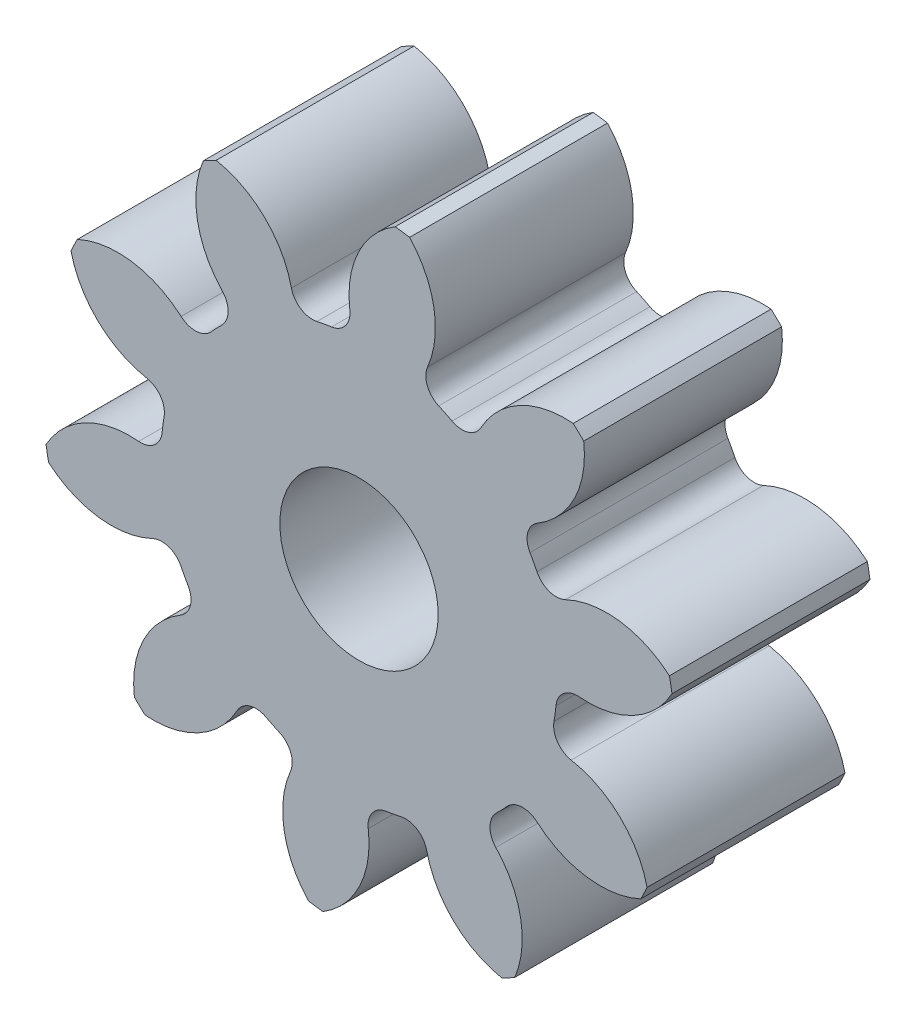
ISO-10303-21;
HEADER;
FILE_DESCRIPTION(('STEP AP214'),'2;1');
FILE_NAME('part.step','',(''),(''),'','','');
FILE_SCHEMA(('AUTOMOTIVE_DESIGN { 1 0 10303 214 1 1 1 1 }'));
ENDSEC;
DATA;
#1=APPLICATION_CONTEXT('core data for automotive mechanical design processes');
#2=APPLICATION_PROTOCOL_DEFINITION('international standard','automotive_design',2000,#1);
#3=PRODUCT_CONTEXT('',#1,'mechanical');
#4=PRODUCT('Part','Part','',(#3));
#5=PRODUCT_RELATED_PRODUCT_CATEGORY('part','',(#4));
#6=PRODUCT_DEFINITION_FORMATION('','',#4);
#7=PRODUCT_DEFINITION_CONTEXT('part definition',#1,'design');
#8=PRODUCT_DEFINITION('design','',#6,#7);
#9=PRODUCT_DEFINITION_SHAPE('','',#8);
#10=(LENGTH_UNIT() NAMED_UNIT(*) SI_UNIT(.MILLI.,.METRE.));
#11=(NAMED_UNIT(*) PLANE_ANGLE_UNIT() SI_UNIT($,.RADIAN.));
#12=(NAMED_UNIT(*) SI_UNIT($,.STERADIAN.) SOLID_ANGLE_UNIT());
#13=UNCERTAINTY_MEASURE_WITH_UNIT(LENGTH_MEASURE(1.E-05),#10,'distance_accuracy_value','');
#14=(GEOMETRIC_REPRESENTATION_CONTEXT(3) GLOBAL_UNCERTAINTY_ASSIGNED_CONTEXT((#13)) GLOBAL_UNIT_ASSIGNED_CONTEXT((#10,
#11,#12)) REPRESENTATION_CONTEXT('',''));
#15=CARTESIAN_POINT('',(0.,0.,0.));
#16=DIRECTION('',(0.,0.,1.));
#17=DIRECTION('',(1.,0.,0.));
#18=AXIS2_PLACEMENT_3D('',#15,#16,#17);
#19=CARTESIAN_POINT('',(0.,0.,127.));
#20=DIRECTION('',(0.,0.,-1.));
#21=DIRECTION('',(-1.,0.,0.));
#22=AXIS2_PLACEMENT_3D('',#19,#20,#21);
#23=CYLINDRICAL_SURFACE('',#22,203.2);
#24=DIRECTION('',(0.,0.,-1.));
#25=VECTOR('',#24,1.);
#26=CARTESIAN_POINT('',(199.155898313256,40.338172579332,63.5));
#27=LINE('',#26,#25);
#28=CARTESIAN_POINT('',(199.155898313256,40.338172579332,127.));
#29=VERTEX_POINT('',#28);
#30=CARTESIAN_POINT('',(199.155898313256,40.338172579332,0.));
#31=VERTEX_POINT('',#30);
#32=EDGE_CURVE('E456',#29,#31,#27,.T.);
#33=ORIENTED_EDGE('',*,*,#32,.F.);
#34=CARTESIAN_POINT('',(0.,0.,127.));
#35=DIRECTION('',(0.,0.,1.));
#36=DIRECTION('',(1.,0.,0.));
#37=AXIS2_PLACEMENT_3D('',#34,#35,#36);
#38=CIRCLE('',#37,203.2);
#39=CARTESIAN_POINT('',(200.800991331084,31.1320073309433,127.));
#40=VERTEX_POINT('',#39);
#41=EDGE_CURVE('E797',#40,#29,#38,.T.);
#42=ORIENTED_EDGE('',*,*,#41,.F.);
#43=DIRECTION('',(0.,0.,-1.));
#44=VECTOR('',#43,1.);
#45=CARTESIAN_POINT('',(200.800991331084,31.1320073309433,63.5));
#46=LINE('',#45,#44);
#47=CARTESIAN_POINT('',(200.800991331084,31.1320073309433,0.));
#48=VERTEX_POINT('',#47);
#49=EDGE_CURVE('E791',#48,#40,#46,.F.);
#50=ORIENTED_EDGE('',*,*,#49,.F.);
#51=CARTESIAN_POINT('',(0.,0.,0.));
#52=DIRECTION('',(0.,0.,1.));
#53=DIRECTION('',(1.,0.,0.));
#54=AXIS2_PLACEMENT_3D('',#51,#52,#53);
#55=CIRCLE('',#54,203.2);
#56=EDGE_CURVE('E802',#48,#31,#55,.T.);
#57=ORIENTED_EDGE('',*,*,#56,.T.);
#58=EDGE_LOOP('',(#33,#42,#50,#57));
#59=FACE_BOUND('',#58,.T.);
#60=ADVANCED_FACE('F33',(#59),#23,.T.);
#61=DIRECTION('',(0.,0.,-1.));
#62=VECTOR('',#61,1.);
#63=CARTESIAN_POINT('',(144.152479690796,143.214184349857,63.5));
#64=LINE('',#63,#62);
#65=CARTESIAN_POINT('',(144.152479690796,143.214184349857,0.));
#66=VERTEX_POINT('',#65);
#67=CARTESIAN_POINT('',(144.152479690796,143.214184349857,127.));
#68=VERTEX_POINT('',#67);
#69=EDGE_CURVE('E427',#66,#68,#64,.F.);
#70=ORIENTED_EDGE('',*,*,#69,.F.);
#71=CARTESIAN_POINT('',(137.410323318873,149.695167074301,0.));
#72=VERTEX_POINT('',#71);
#73=EDGE_CURVE('E805',#66,#72,#55,.T.);
#74=ORIENTED_EDGE('',*,*,#73,.T.);
#75=DIRECTION('',(0.,0.,-1.));
#76=VECTOR('',#75,1.);
#77=CARTESIAN_POINT('',(137.410323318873,149.695167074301,63.5));
#78=LINE('',#77,#76);
#79=CARTESIAN_POINT('',(137.410323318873,149.695167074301,127.));
#80=VERTEX_POINT('',#79);
#81=EDGE_CURVE('E489',#80,#72,#78,.T.);
#82=ORIENTED_EDGE('',*,*,#81,.F.);
#83=EDGE_CURVE('E800',#68,#80,#38,.T.);
#84=ORIENTED_EDGE('',*,*,#83,.F.);
#85=EDGE_LOOP('',(#70,#74,#82,#84));
#86=FACE_BOUND('',#85,.T.);
#87=ADVANCED_FACE('F921',(#86),#23,.T.);
#88=CARTESIAN_POINT('',(0.,0.,127.));
#89=DIRECTION('',(0.,0.,1.));
#90=DIRECTION('',(1.,0.,0.));
#91=AXIS2_PLACEMENT_3D('',#88,#89,#90);
#92=PLANE('',#91);
#93=CARTESIAN_POINT('',(0.,0.,127.000000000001));
#94=DIRECTION('',(0.,0.,1.));
#95=DIRECTION('',(1.,0.,0.));
#96=AXIS2_PLACEMENT_3D('',#93,#94,#95);
#97=CIRCLE('',#96,50.8);
#98=CARTESIAN_POINT('',(50.8,0.,127.000000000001));
#99=VERTEX_POINT('',#98);
#100=EDGE_CURVE('E444',#99,#99,#97,.T.);
#101=ORIENTED_EDGE('',*,*,#100,.F.);
#102=EDGE_LOOP('',(#101));
#103=FACE_BOUND('',#102,.T.);
#104=ORIENTED_EDGE('',*,*,#41,.T.);
#105=CARTESIAN_POINT('',(159.00002399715,-6.21090353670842,127.));
#106=DIRECTION('',(0.,0.,-1.));
#107=DIRECTION('',(0.809016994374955,0.587785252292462,0.));
#108=AXIS2_PLACEMENT_3D('',#105,#106,#107);
#109=CIRCLE('',#108,61.476098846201);
#110=CARTESIAN_POINT('',(132.490668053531,49.2558863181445,127.));
#111=VERTEX_POINT('',#110);
#112=EDGE_CURVE('E436',#111,#29,#109,.T.);
#113=ORIENTED_EDGE('',*,*,#112,.F.);
#114=CARTESIAN_POINT('',(126.546928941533,61.6922551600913,127.));
#115=DIRECTION('',(0.,0.,1.));
#116=DIRECTION('',(-0.809016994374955,-0.587785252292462,0.));
#117=AXIS2_PLACEMENT_3D('',#114,#115,#116);
#118=CIRCLE('',#117,13.7837333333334);
#119=CARTESIAN_POINT('',(114.157080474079,55.6521426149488,127.));
#120=VERTEX_POINT('',#119);
#121=EDGE_CURVE('E434',#120,#111,#118,.T.);
#122=ORIENTED_EDGE('',*,*,#121,.F.);
#123=CARTESIAN_POINT('',(0.,0.,127.));
#124=DIRECTION('',(0.,0.,-1.));
#125=DIRECTION('',(0.809016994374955,0.587785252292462,0.));
#126=AXIS2_PLACEMENT_3D('',#123,#124,#125);
#127=CIRCLE('',#126,127.);
#128=CARTESIAN_POINT('',(109.680780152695,64.0244208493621,127.));
#129=VERTEX_POINT('',#128);
#130=EDGE_CURVE('E419',#129,#120,#127,.T.);
#131=ORIENTED_EDGE('',*,*,#130,.F.);
#132=CARTESIAN_POINT('',(121.584800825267,70.9732046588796,127.));
#133=DIRECTION('',(0.,0.,1.));
#134=DIRECTION('',(-0.809016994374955,-0.587785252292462,0.));
#135=AXIS2_PLACEMENT_3D('',#132,#133,#134);
#136=CIRCLE('',#135,13.7837333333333);
#137=CARTESIAN_POINT('',(114.543806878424,82.8229181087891,127.));
#138=VERTEX_POINT('',#137);
#139=EDGE_CURVE('E411',#138,#129,#136,.T.);
#140=ORIENTED_EDGE('',*,*,#139,.F.);
#141=CARTESIAN_POINT('',(83.1406427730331,135.673197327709,127.));
#142=DIRECTION('',(0.,0.,-1.));
#143=DIRECTION('',(-0.809016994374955,-0.587785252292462,0.));
#144=AXIS2_PLACEMENT_3D('',#141,#142,#143);
#145=CIRCLE('',#144,61.476098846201);
#146=EDGE_CURVE('E441',#68,#138,#145,.T.);
#147=ORIENTED_EDGE('',*,*,#146,.F.);
#148=ORIENTED_EDGE('',*,*,#83,.T.);
#149=CARTESIAN_POINT('',(132.284399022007,88.4331427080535,127.));
#150=DIRECTION('',(0.,0.,-1.));
#151=DIRECTION('',(0.309016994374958,0.95105651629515,0.));
#152=AXIS2_PLACEMENT_3D('',#149,#150,#151);
#153=CIRCLE('',#152,61.476098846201);
#154=CARTESIAN_POINT('',(78.2353184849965,117.724909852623,127.));
#155=VERTEX_POINT('',#154);
#156=EDGE_CURVE('E465',#155,#80,#153,.T.);
#157=ORIENTED_EDGE('',*,*,#156,.F.);
#158=CARTESIAN_POINT('',(66.1168183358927,124.292501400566,127.));
#159=DIRECTION('',(0.,0.,1.));
#160=DIRECTION('',(-0.309016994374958,-0.95105651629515,0.));
#161=AXIS2_PLACEMENT_3D('',#158,#159,#160);
#162=CIRCLE('',#161,13.7837333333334);
#163=CARTESIAN_POINT('',(59.643509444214,112.123377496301,127.));
#164=VERTEX_POINT('',#163);
#165=EDGE_CURVE('E463',#164,#155,#162,.T.);
#166=ORIENTED_EDGE('',*,*,#165,.F.);
#167=CARTESIAN_POINT('',(0.,0.,127.));
#168=DIRECTION('',(0.,0.,-1.));
#169=DIRECTION('',(0.309016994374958,0.95105651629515,0.));
#170=AXIS2_PLACEMENT_3D('',#167,#168,#169);
#171=CIRCLE('',#170,127.);
#172=CARTESIAN_POINT('',(51.1010047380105,116.265589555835,127.));
#173=VERTEX_POINT('',#172);
#174=EDGE_CURVE('E460',#173,#164,#171,.T.);
#175=ORIENTED_EDGE('',*,*,#174,.F.);
#176=CARTESIAN_POINT('',(56.6471671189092,128.884281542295,127.));
#177=DIRECTION('',(0.,0.,1.));
#178=DIRECTION('',(-0.309016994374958,-0.95105651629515,0.));
#179=AXIS2_PLACEMENT_3D('',#176,#177,#178);
#180=CIRCLE('',#179,13.7837333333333);
#181=CARTESIAN_POINT('',(43.9857965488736,134.33230869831,127.));
#182=VERTEX_POINT('',#181);
#183=EDGE_CURVE('E458',#182,#173,#180,.T.);
#184=ORIENTED_EDGE('',*,*,#183,.F.);
#185=CARTESIAN_POINT('',(-12.4845115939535,158.630766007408,127.));
#186=DIRECTION('',(0.,0.,-1.));
#187=DIRECTION('',(-0.309016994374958,-0.95105651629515,0.));
#188=AXIS2_PLACEMENT_3D('',#185,#186,#187);
#189=CIRCLE('',#188,61.476098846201);
#190=CARTESIAN_POINT('',(32.4426203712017,200.593410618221,127.));
#191=VERTEX_POINT('',#190);
#192=EDGE_CURVE('E468',#191,#182,#189,.T.);
#193=ORIENTED_EDGE('',*,*,#192,.F.);
#194=CARTESIAN_POINT('',(23.1786752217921,201.87369569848,127.));
#195=VERTEX_POINT('',#194);
#196=EDGE_CURVE('E833',#191,#195,#38,.T.);
#197=ORIENTED_EDGE('',*,*,#196,.T.);
#198=CARTESIAN_POINT('',(55.0406298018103,149.298734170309,127.));
#199=DIRECTION('',(0.,0.,-1.));
#200=DIRECTION('',(-0.309016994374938,0.951056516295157,0.));
#201=AXIS2_PLACEMENT_3D('',#198,#199,#200);
#202=CIRCLE('',#201,61.476098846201);
#203=CARTESIAN_POINT('',(-5.9032636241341,141.227019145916,127.));
#204=VERTEX_POINT('',#203);
#205=EDGE_CURVE('E500',#204,#195,#202,.T.);
#206=ORIENTED_EDGE('',*,*,#205,.F.);
#207=CARTESIAN_POINT('',(-19.5676696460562,139.417236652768,127.));
#208=DIRECTION('',(0.,0.,1.));
#209=DIRECTION('',(0.309016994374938,-0.951056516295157,0.));
#210=AXIS2_PLACEMENT_3D('',#207,#208,#209);
#211=CIRCLE('',#210,13.7837333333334);
#212=CARTESIAN_POINT('',(-17.6518549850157,125.767293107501,127.));
#213=VERTEX_POINT('',#212);
#214=EDGE_CURVE('E498',#213,#204,#211,.T.);
#215=ORIENTED_EDGE('',*,*,#214,.F.);
#216=CARTESIAN_POINT('',(0.,0.,127.));
#217=DIRECTION('',(0.,0.,-1.));
#218=DIRECTION('',(-0.309016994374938,0.951056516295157,0.));
#219=AXIS2_PLACEMENT_3D('',#216,#217,#218);
#220=CIRCLE('',#219,127.);
#221=CARTESIAN_POINT('',(-26.9976176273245,124.097254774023,127.));
#222=VERTEX_POINT('',#221);
#223=EDGE_CURVE('E495',#222,#213,#220,.T.);
#224=ORIENTED_EDGE('',*,*,#223,.F.);
#225=CARTESIAN_POINT('',(-29.9277590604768,137.565943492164,127.));
#226=DIRECTION('',(0.,0.,1.));
#227=DIRECTION('',(0.309016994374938,-0.951056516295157,0.));
#228=AXIS2_PLACEMENT_3D('',#225,#226,#227);
#229=CIRCLE('',#228,13.7837333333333);
#230=CARTESIAN_POINT('',(-43.3732930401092,134.531323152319,127.));
#231=VERTEX_POINT('',#230);
#232=EDGE_CURVE('E493',#231,#222,#229,.T.);
#233=ORIENTED_EDGE('',*,*,#232,.F.);
#234=CARTESIAN_POINT('',(-103.341006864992,120.996773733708,127.));
#235=DIRECTION('',(0.,0.,-1.));
#236=DIRECTION('',(0.309016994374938,-0.951056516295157,0.));
#237=AXIS2_PLACEMENT_3D('',#234,#235,#236);
#238=CIRCLE('',#237,61.476098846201);
#239=CARTESIAN_POINT('',(-91.6592172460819,181.352771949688,127.));
#240=VERTEX_POINT('',#239);
#241=EDGE_CURVE('E503',#240,#231,#238,.T.);
#242=ORIENTED_EDGE('',*,*,#241,.F.);
#243=CARTESIAN_POINT('',(-99.9064389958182,176.943334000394,127.));
#244=VERTEX_POINT('',#243);
#245=EDGE_CURVE('E903',#240,#244,#38,.T.);
#246=ORIENTED_EDGE('',*,*,#245,.T.);
#247=CARTESIAN_POINT('',(-43.2267892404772,153.137283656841,127.));
#248=DIRECTION('',(0.,0.,-1.));
#249=DIRECTION('',(-0.809016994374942,0.58778525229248,0.));
#250=AXIS2_PLACEMENT_3D('',#247,#248,#249);
#251=CIRCLE('',#250,61.476098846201);
#252=CARTESIAN_POINT('',(-87.7869996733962,110.785207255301,127.));
#253=VERTEX_POINT('',#252);
#254=EDGE_CURVE('E538',#253,#244,#251,.T.);
#255=ORIENTED_EDGE('',*,*,#254,.F.);
#256=CARTESIAN_POINT('',(-97.777972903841,101.2893261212,127.));
#257=DIRECTION('',(0.,0.,1.));
#258=DIRECTION('',(0.809016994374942,-0.58778525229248,0.));
#259=AXIS2_PLACEMENT_3D('',#256,#257,#258);
#260=CIRCLE('',#259,13.7837333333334);
#261=CARTESIAN_POINT('',(-88.2048107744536,91.3723774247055,127.));
#262=VERTEX_POINT('',#261);
#263=EDGE_CURVE('E536',#262,#253,#260,.T.);
#264=ORIENTED_EDGE('',*,*,#263,.F.);
#265=CARTESIAN_POINT('',(0.,0.,127.));
#266=DIRECTION('',(0.,0.,-1.));
#267=DIRECTION('',(-0.809016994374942,0.58778525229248,0.));
#268=AXIS2_PLACEMENT_3D('',#265,#266,#267);
#269=CIRCLE('',#268,127.);
#270=CARTESIAN_POINT('',(-94.7840676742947,84.5279865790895,127.));
#271=VERTEX_POINT('',#270);
#272=EDGE_CURVE('E533',#271,#262,#269,.T.);
#273=ORIENTED_EDGE('',*,*,#272,.F.);
#274=CARTESIAN_POINT('',(-105.071298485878,93.7020907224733,127.));
#275=DIRECTION('',(0.,0.,1.));
#276=DIRECTION('',(0.809016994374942,-0.58778525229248,0.));
#277=AXIS2_PLACEMENT_3D('',#274,#275,#276);
#278=CIRCLE('',#277,13.7837333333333);
#279=CARTESIAN_POINT('',(-114.165258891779,83.3439447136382,127.));
#280=VERTEX_POINT('',#279);
#281=EDGE_CURVE('E531',#280,#271,#278,.T.);
#282=ORIENTED_EDGE('',*,*,#281,.F.);
#283=CARTESIAN_POINT('',(-154.72474994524,37.1461264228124,127.));
#284=DIRECTION('',(0.,0.,-1.));
#285=DIRECTION('',(0.809016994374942,-0.58778525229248,0.));
#286=AXIS2_PLACEMENT_3D('',#283,#284,#285);
#287=CIRCLE('',#286,61.476098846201);
#288=CARTESIAN_POINT('',(-180.750349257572,92.8415383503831,127.));
#289=VERTEX_POINT('',#288);
#290=EDGE_CURVE('E541',#289,#280,#287,.T.);
#291=ORIENTED_EDGE('',*,*,#290,.F.);
#292=CARTESIAN_POINT('',(-184.830689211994,84.4266327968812,127.));
#293=VERTEX_POINT('',#292);
#294=EDGE_CURVE('E899',#289,#293,#38,.T.);
#295=ORIENTED_EDGE('',*,*,#294,.T.);
#296=CARTESIAN_POINT('',(-124.983044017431,98.4825957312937,127.));
#297=DIRECTION('',(0.,0.,-1.));
#298=DIRECTION('',(-1.,0.,0.));
#299=AXIS2_PLACEMENT_3D('',#296,#297,#298);
#300=CIRCLE('',#299,61.476098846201);
#301=CARTESIAN_POINT('',(-136.139085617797,38.0272116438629,127.));
#302=VERTEX_POINT('',#301);
#303=EDGE_CURVE('E576',#302,#293,#300,.T.);
#304=ORIENTED_EDGE('',*,*,#303,.F.);
#305=CARTESIAN_POINT('',(-138.640413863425,24.4723357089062,127.));
#306=DIRECTION('',(0.,0.,1.));
#307=DIRECTION('',(1.,0.,0.));
#308=AXIS2_PLACEMENT_3D('',#305,#306,#307);
#309=CIRCLE('',#308,13.7837333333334);
#310=CARTESIAN_POINT('',(-125.066526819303,22.0763191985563,127.));
#311=VERTEX_POINT('',#310);
#312=EDGE_CURVE('E574',#311,#302,#309,.T.);
#313=ORIENTED_EDGE('',*,*,#312,.F.);
#314=CARTESIAN_POINT('',(0.,0.,127.));
#315=DIRECTION('',(0.,0.,-1.));
#316=DIRECTION('',(-1.,0.,0.));
#317=AXIS2_PLACEMENT_3D('',#314,#315,#316);
#318=CIRCLE('',#317,127.);
#319=CARTESIAN_POINT('',(-126.366225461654,12.6719005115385,127.));
#320=VERTEX_POINT('',#319);
#321=EDGE_CURVE('E571',#320,#311,#318,.T.);
#322=ORIENTED_EDGE('',*,*,#321,.F.);
#323=CARTESIAN_POINT('',(-140.081173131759,14.0472241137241,127.));
#324=DIRECTION('',(0.,0.,1.));
#325=DIRECTION('',(1.,0.,0.));
#326=AXIS2_PLACEMENT_3D('',#323,#324,#325);
#327=CIRCLE('',#326,13.7837333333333);
#328=CARTESIAN_POINT('',(-141.349976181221,0.322012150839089,127.));
#329=VERTEX_POINT('',#328);
#330=EDGE_CURVE('E569',#329,#320,#327,.T.);
#331=ORIENTED_EDGE('',*,*,#330,.F.);
#332=CARTESIAN_POINT('',(-147.008897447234,-60.8930786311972,127.));
#333=DIRECTION('',(0.,0.,-1.));
#334=DIRECTION('',(1.,0.,0.));
#335=AXIS2_PLACEMENT_3D('',#332,#333,#334);
#336=CIRCLE('',#335,61.476098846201);
#337=CARTESIAN_POINT('',(-200.800991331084,-31.1320073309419,127.));
#338=VERTEX_POINT('',#337);
#339=EDGE_CURVE('E579',#338,#329,#336,.T.);
#340=ORIENTED_EDGE('',*,*,#339,.F.);
#341=CARTESIAN_POINT('',(-199.155898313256,-40.3381725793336,127.));
#342=VERTEX_POINT('',#341);
#343=EDGE_CURVE('E895',#338,#342,#38,.T.);
#344=ORIENTED_EDGE('',*,*,#343,.T.);
#345=CARTESIAN_POINT('',(-159.00002399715,6.21090353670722,127.));
#346=DIRECTION('',(0.,0.,-1.));
#347=DIRECTION('',(-0.809016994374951,-0.587785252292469,0.));
#348=AXIS2_PLACEMENT_3D('',#345,#346,#347);
#349=CIRCLE('',#348,61.476098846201);
#350=CARTESIAN_POINT('',(-132.490668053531,-49.2558863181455,127.));
#351=VERTEX_POINT('',#350);
#352=EDGE_CURVE('E614',#351,#342,#349,.T.);
#353=ORIENTED_EDGE('',*,*,#352,.F.);
#354=CARTESIAN_POINT('',(-126.546928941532,-61.6922551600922,127.));
#355=DIRECTION('',(0.,0.,1.));
#356=DIRECTION('',(0.809016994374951,0.587785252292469,0.));
#357=AXIS2_PLACEMENT_3D('',#354,#355,#356);
#358=CIRCLE('',#357,13.7837333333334);
#359=CARTESIAN_POINT('',(-114.157080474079,-55.6521426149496,127.));
#360=VERTEX_POINT('',#359);
#361=EDGE_CURVE('E612',#360,#351,#358,.T.);
#362=ORIENTED_EDGE('',*,*,#361,.F.);
#363=CARTESIAN_POINT('',(0.,0.,127.));
#364=DIRECTION('',(0.,0.,-1.));
#365=DIRECTION('',(-0.809016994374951,-0.587785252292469,0.));
#366=AXIS2_PLACEMENT_3D('',#363,#364,#365);
#367=CIRCLE('',#366,127.);
#368=CARTESIAN_POINT('',(-109.680780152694,-64.024420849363,127.));
#369=VERTEX_POINT('',#368);
#370=EDGE_CURVE('E609',#369,#360,#367,.T.);
#371=ORIENTED_EDGE('',*,*,#370,.F.);
#372=CARTESIAN_POINT('',(-121.584800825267,-70.9732046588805,127.));
#373=DIRECTION('',(0.,0.,1.));
#374=DIRECTION('',(0.809016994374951,0.587785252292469,0.));
#375=AXIS2_PLACEMENT_3D('',#372,#373,#374);
#376=CIRCLE('',#375,13.7837333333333);
#377=CARTESIAN_POINT('',(-114.543806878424,-82.82291810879,127.));
#378=VERTEX_POINT('',#377);
#379=EDGE_CURVE('E607',#378,#369,#376,.T.);
#380=ORIENTED_EDGE('',*,*,#379,.F.);
#381=CARTESIAN_POINT('',(-83.1406427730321,-135.673197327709,127.));
#382=DIRECTION('',(0.,0.,-1.));
#383=DIRECTION('',(0.809016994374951,0.587785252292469,0.));
#384=AXIS2_PLACEMENT_3D('',#381,#382,#383);
#385=CIRCLE('',#384,61.476098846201);
#386=CARTESIAN_POINT('',(-144.152479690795,-143.214184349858,127.));
#387=VERTEX_POINT('',#386);
#388=EDGE_CURVE('E617',#387,#378,#385,.T.);
#389=ORIENTED_EDGE('',*,*,#388,.F.);
#390=CARTESIAN_POINT('',(-137.410323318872,-149.695167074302,127.));
#391=VERTEX_POINT('',#390);
#392=EDGE_CURVE('E891',#387,#391,#38,.T.);
#393=ORIENTED_EDGE('',*,*,#392,.T.);
#394=CARTESIAN_POINT('',(-132.284399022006,-88.4331427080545,127.));
#395=DIRECTION('',(0.,0.,-1.));
#396=DIRECTION('',(-0.309016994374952,-0.951056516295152,0.));
#397=AXIS2_PLACEMENT_3D('',#394,#395,#396);
#398=CIRCLE('',#397,61.476098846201);
#399=CARTESIAN_POINT('',(-78.2353184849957,-117.724909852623,127.));
#400=VERTEX_POINT('',#399);
#401=EDGE_CURVE('E652',#400,#391,#398,.T.);
#402=ORIENTED_EDGE('',*,*,#401,.F.);
#403=CARTESIAN_POINT('',(-66.1168183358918,-124.292501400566,127.));
#404=DIRECTION('',(0.,0.,1.));
#405=DIRECTION('',(0.309016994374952,0.951056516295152,0.));
#406=AXIS2_PLACEMENT_3D('',#403,#404,#405);
#407=CIRCLE('',#406,13.7837333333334);
#408=CARTESIAN_POINT('',(-59.6435094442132,-112.123377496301,127.));
#409=VERTEX_POINT('',#408);
#410=EDGE_CURVE('E650',#409,#400,#407,.T.);
#411=ORIENTED_EDGE('',*,*,#410,.F.);
#412=CARTESIAN_POINT('',(0.,0.,127.));
#413=DIRECTION('',(0.,0.,-1.));
#414=DIRECTION('',(-0.309016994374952,-0.951056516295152,0.));
#415=AXIS2_PLACEMENT_3D('',#412,#413,#414);
#416=CIRCLE('',#415,127.);
#417=CARTESIAN_POINT('',(-51.1010047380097,-116.265589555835,127.));
#418=VERTEX_POINT('',#417);
#419=EDGE_CURVE('E647',#418,#409,#416,.T.);
#420=ORIENTED_EDGE('',*,*,#419,.F.);
#421=CARTESIAN_POINT('',(-56.6471671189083,-128.884281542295,127.));
#422=DIRECTION('',(0.,0.,1.));
#423=DIRECTION('',(0.309016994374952,0.951056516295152,0.));
#424=AXIS2_PLACEMENT_3D('',#421,#422,#423);
#425=CIRCLE('',#424,13.7837333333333);
#426=CARTESIAN_POINT('',(-43.9857965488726,-134.33230869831,127.));
#427=VERTEX_POINT('',#426);
#428=EDGE_CURVE('E645',#427,#418,#425,.T.);
#429=ORIENTED_EDGE('',*,*,#428,.F.);
#430=CARTESIAN_POINT('',(12.4845115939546,-158.630766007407,127.));
#431=DIRECTION('',(0.,0.,-1.));
#432=DIRECTION('',(0.309016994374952,0.951056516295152,0.));
#433=AXIS2_PLACEMENT_3D('',#430,#431,#432);
#434=CIRCLE('',#433,61.476098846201);
#435=CARTESIAN_POINT('',(-32.4426203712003,-200.593410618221,127.));
#436=VERTEX_POINT('',#435);
#437=EDGE_CURVE('E655',#436,#427,#434,.T.);
#438=ORIENTED_EDGE('',*,*,#437,.F.);
#439=CARTESIAN_POINT('',(-23.1786752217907,-201.873695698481,127.));
#440=VERTEX_POINT('',#439);
#441=EDGE_CURVE('E887',#436,#440,#38,.T.);
#442=ORIENTED_EDGE('',*,*,#441,.T.);
#443=CARTESIAN_POINT('',(-55.0406298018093,-149.298734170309,127.));
#444=DIRECTION('',(0.,0.,-1.));
#445=DIRECTION('',(0.309016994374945,-0.951056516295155,0.));
#446=AXIS2_PLACEMENT_3D('',#443,#444,#445);
#447=CIRCLE('',#446,61.476098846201);
#448=CARTESIAN_POINT('',(5.90326362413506,-141.227019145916,127.));
#449=VERTEX_POINT('',#448);
#450=EDGE_CURVE('E690',#449,#440,#447,.T.);
#451=ORIENTED_EDGE('',*,*,#450,.F.);
#452=CARTESIAN_POINT('',(19.5676696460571,-139.417236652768,127.));
#453=DIRECTION('',(0.,0.,1.));
#454=DIRECTION('',(-0.309016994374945,0.951056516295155,0.));
#455=AXIS2_PLACEMENT_3D('',#452,#453,#454);
#456=CIRCLE('',#455,13.7837333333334);
#457=CARTESIAN_POINT('',(17.6518549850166,-125.767293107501,127.));
#458=VERTEX_POINT('',#457);
#459=EDGE_CURVE('E688',#458,#449,#456,.T.);
#460=ORIENTED_EDGE('',*,*,#459,.F.);
#461=CARTESIAN_POINT('',(0.,0.,127.));
#462=DIRECTION('',(0.,0.,-1.));
#463=DIRECTION('',(0.309016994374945,-0.951056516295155,0.));
#464=AXIS2_PLACEMENT_3D('',#461,#462,#463);
#465=CIRCLE('',#464,127.);
#466=CARTESIAN_POINT('',(26.9976176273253,-124.097254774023,127.));
#467=VERTEX_POINT('',#466);
#468=EDGE_CURVE('E685',#467,#458,#465,.T.);
#469=ORIENTED_EDGE('',*,*,#468,.F.);
#470=CARTESIAN_POINT('',(29.9277590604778,-137.565943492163,127.));
#471=DIRECTION('',(0.,0.,1.));
#472=DIRECTION('',(-0.309016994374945,0.951056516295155,0.));
#473=AXIS2_PLACEMENT_3D('',#470,#471,#472);
#474=CIRCLE('',#473,13.7837333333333);
#475=CARTESIAN_POINT('',(43.3732930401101,-134.531323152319,127.));
#476=VERTEX_POINT('',#475);
#477=EDGE_CURVE('E683',#476,#467,#474,.T.);
#478=ORIENTED_EDGE('',*,*,#477,.F.);
#479=CARTESIAN_POINT('',(103.341006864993,-120.996773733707,127.));
#480=DIRECTION('',(0.,0.,-1.));
#481=DIRECTION('',(-0.309016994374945,0.951056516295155,0.));
#482=AXIS2_PLACEMENT_3D('',#479,#480,#481);
#483=CIRCLE('',#482,61.476098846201);
#484=CARTESIAN_POINT('',(91.6592172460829,-181.352771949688,127.));
#485=VERTEX_POINT('',#484);
#486=EDGE_CURVE('E693',#485,#476,#483,.T.);
#487=ORIENTED_EDGE('',*,*,#486,.F.);
#488=CARTESIAN_POINT('',(99.9064389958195,-176.943334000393,127.));
#489=VERTEX_POINT('',#488);
#490=EDGE_CURVE('E886',#485,#489,#38,.T.);
#491=ORIENTED_EDGE('',*,*,#490,.T.);
#492=CARTESIAN_POINT('',(43.2267892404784,-153.137283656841,127.));
#493=DIRECTION('',(0.,0.,-1.));
#494=DIRECTION('',(0.809016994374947,-0.587785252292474,0.));
#495=AXIS2_PLACEMENT_3D('',#492,#493,#494);
#496=CIRCLE('',#495,61.476098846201);
#497=CARTESIAN_POINT('',(87.786999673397,-110.785207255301,127.));
#498=VERTEX_POINT('',#497);
#499=EDGE_CURVE('E728',#498,#489,#496,.T.);
#500=ORIENTED_EDGE('',*,*,#499,.F.);
#501=CARTESIAN_POINT('',(97.7779729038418,-101.289326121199,127.));
#502=DIRECTION('',(0.,0.,1.));
#503=DIRECTION('',(-0.809016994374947,0.587785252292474,0.));
#504=AXIS2_PLACEMENT_3D('',#501,#502,#503);
#505=CIRCLE('',#504,13.7837333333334);
#506=CARTESIAN_POINT('',(88.2048107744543,-91.3723774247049,127.));
#507=VERTEX_POINT('',#506);
#508=EDGE_CURVE('E726',#507,#498,#505,.T.);
#509=ORIENTED_EDGE('',*,*,#508,.F.);
#510=CARTESIAN_POINT('',(0.,0.,127.));
#511=DIRECTION('',(0.,0.,-1.));
#512=DIRECTION('',(0.809016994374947,-0.587785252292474,0.));
#513=AXIS2_PLACEMENT_3D('',#510,#511,#512);
#514=CIRCLE('',#513,127.);
#515=CARTESIAN_POINT('',(94.7840676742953,-84.5279865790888,127.));
#516=VERTEX_POINT('',#515);
#517=EDGE_CURVE('E723',#516,#507,#514,.T.);
#518=ORIENTED_EDGE('',*,*,#517,.F.);
#519=CARTESIAN_POINT('',(105.071298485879,-93.7020907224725,127.));
#520=DIRECTION('',(0.,0.,1.));
#521=DIRECTION('',(-0.809016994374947,0.587785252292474,0.));
#522=AXIS2_PLACEMENT_3D('',#519,#520,#521);
#523=CIRCLE('',#522,13.7837333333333);
#524=CARTESIAN_POINT('',(114.16525889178,-83.3439447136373,127.));
#525=VERTEX_POINT('',#524);
#526=EDGE_CURVE('E721',#525,#516,#523,.T.);
#527=ORIENTED_EDGE('',*,*,#526,.F.);
#528=CARTESIAN_POINT('',(154.72474994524,-37.1461264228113,127.));
#529=DIRECTION('',(0.,0.,-1.));
#530=DIRECTION('',(-0.809016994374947,0.587785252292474,0.));
#531=AXIS2_PLACEMENT_3D('',#528,#529,#530);
#532=CIRCLE('',#531,61.476098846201);
#533=CARTESIAN_POINT('',(180.750349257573,-92.8415383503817,127.));
#534=VERTEX_POINT('',#533);
#535=EDGE_CURVE('E731',#534,#525,#532,.T.);
#536=ORIENTED_EDGE('',*,*,#535,.F.);
#537=CARTESIAN_POINT('',(184.830689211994,-84.4266327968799,127.));
#538=VERTEX_POINT('',#537);
#539=EDGE_CURVE('E801',#534,#538,#38,.T.);
#540=ORIENTED_EDGE('',*,*,#539,.T.);
#541=CARTESIAN_POINT('',(124.983044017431,-98.4825957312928,127.));
#542=DIRECTION('',(0.,0.,-1.));
#543=DIRECTION('',(1.,0.,0.));
#544=AXIS2_PLACEMENT_3D('',#541,#542,#543);
#545=CIRCLE('',#544,61.476098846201);
#546=CARTESIAN_POINT('',(136.139085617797,-38.0272116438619,127.));
#547=VERTEX_POINT('',#546);
#548=EDGE_CURVE('E766',#547,#538,#545,.T.);
#549=ORIENTED_EDGE('',*,*,#548,.F.);
#550=CARTESIAN_POINT('',(138.640413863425,-24.4723357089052,127.));
#551=DIRECTION('',(0.,0.,1.));
#552=DIRECTION('',(-1.,0.,0.));
#553=AXIS2_PLACEMENT_3D('',#550,#551,#552);
#554=CIRCLE('',#553,13.7837333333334);
#555=CARTESIAN_POINT('',(125.066526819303,-22.0763191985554,127.));
#556=VERTEX_POINT('',#555);
#557=EDGE_CURVE('E764',#556,#547,#554,.T.);
#558=ORIENTED_EDGE('',*,*,#557,.F.);
#559=CARTESIAN_POINT('',(0.,0.,127.));
#560=DIRECTION('',(0.,0.,-1.));
#561=DIRECTION('',(1.,0.,0.));
#562=AXIS2_PLACEMENT_3D('',#559,#560,#561);
#563=CIRCLE('',#562,127.);
#564=CARTESIAN_POINT('',(126.366225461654,-12.6719005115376,127.));
#565=VERTEX_POINT('',#564);
#566=EDGE_CURVE('E761',#565,#556,#563,.T.);
#567=ORIENTED_EDGE('',*,*,#566,.F.);
#568=CARTESIAN_POINT('',(140.081173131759,-14.0472241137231,127.));
#569=DIRECTION('',(0.,0.,1.));
#570=DIRECTION('',(-1.,0.,0.));
#571=AXIS2_PLACEMENT_3D('',#568,#569,#570);
#572=CIRCLE('',#571,13.7837333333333);
#573=CARTESIAN_POINT('',(141.349976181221,-0.322012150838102,127.));
#574=VERTEX_POINT('',#573);
#575=EDGE_CURVE('E759',#574,#565,#572,.T.);
#576=ORIENTED_EDGE('',*,*,#575,.F.);
#577=CARTESIAN_POINT('',(147.008897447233,60.8930786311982,127.));
#578=DIRECTION('',(0.,0.,-1.));
#579=DIRECTION('',(-1.,0.,0.));
#580=AXIS2_PLACEMENT_3D('',#577,#578,#579);
#581=CIRCLE('',#580,61.476098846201);
#582=EDGE_CURVE('E769',#40,#574,#581,.T.);
#583=ORIENTED_EDGE('',*,*,#582,.F.);
#584=EDGE_LOOP('',(#104,#113,#122,#131,#140,#147,#148,#157,#166,#175,#184,#193,#197,#206,#215,
#224,#233,#242,#246,#255,#264,#273,#282,#291,#295,#304,#313,#322,#331,#340,#344,#353,#362,#371,
#380,#389,#393,#402,#411,#420,#429,#438,#442,#451,#460,#469,#478,#487,#491,#500,#509,#518,#527,
#536,#540,#549,#558,#567,#576,#583));
#585=FACE_BOUND('',#584,.T.);
#586=ADVANCED_FACE('F432',(#103,#585),#92,.T.);
#587=CARTESIAN_POINT('',(0.,0.,0.));
#588=DIRECTION('',(0.,0.,1.));
#589=DIRECTION('',(1.,0.,0.));
#590=AXIS2_PLACEMENT_3D('',#587,#588,#589);
#591=PLANE('',#590);
#592=CARTESIAN_POINT('',(0.,0.,0.));
#593=DIRECTION('',(0.,0.,1.));
#594=DIRECTION('',(1.,0.,0.));
#595=AXIS2_PLACEMENT_3D('',#592,#593,#594);
#596=CIRCLE('',#595,50.8);
#597=CARTESIAN_POINT('',(50.8,0.,-1.77635683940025E-12));
#598=VERTEX_POINT('',#597);
#599=EDGE_CURVE('E36',#598,#598,#596,.T.);
#600=ORIENTED_EDGE('',*,*,#599,.T.);
#601=EDGE_LOOP('',(#600));
#602=FACE_BOUND('',#601,.T.);
#603=CARTESIAN_POINT('',(159.00002399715,-6.21090353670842,0.));
#604=DIRECTION('',(0.,0.,-1.));
#605=DIRECTION('',(0.809016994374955,0.587785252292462,0.));
#606=AXIS2_PLACEMENT_3D('',#603,#604,#605);
#607=CIRCLE('',#606,61.476098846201);
#608=CARTESIAN_POINT('',(132.490668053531,49.2558863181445,0.));
#609=VERTEX_POINT('',#608);
#610=EDGE_CURVE('E420',#609,#31,#607,.T.);
#611=ORIENTED_EDGE('',*,*,#610,.T.);
#612=ORIENTED_EDGE('',*,*,#56,.F.);
#613=CARTESIAN_POINT('',(147.008897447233,60.8930786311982,0.));
#614=DIRECTION('',(0.,0.,1.));
#615=DIRECTION('',(1.,0.,0.));
#616=AXIS2_PLACEMENT_3D('',#613,#614,#615);
#617=CIRCLE('',#616,61.476098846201);
#618=CARTESIAN_POINT('',(141.349976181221,-0.322012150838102,0.));
#619=VERTEX_POINT('',#618);
#620=EDGE_CURVE('E799',#619,#48,#617,.T.);
#621=ORIENTED_EDGE('',*,*,#620,.F.);
#622=CARTESIAN_POINT('',(140.081173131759,-14.0472241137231,0.));
#623=DIRECTION('',(0.,0.,1.));
#624=DIRECTION('',(-1.,0.,0.));
#625=AXIS2_PLACEMENT_3D('',#622,#623,#624);
#626=CIRCLE('',#625,13.7837333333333);
#627=CARTESIAN_POINT('',(126.366225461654,-12.6719005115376,0.));
#628=VERTEX_POINT('',#627);
#629=EDGE_CURVE('E758',#619,#628,#626,.T.);
#630=ORIENTED_EDGE('',*,*,#629,.T.);
#631=CARTESIAN_POINT('',(0.,0.,0.));
#632=DIRECTION('',(0.,0.,-1.));
#633=DIRECTION('',(1.,0.,0.));
#634=AXIS2_PLACEMENT_3D('',#631,#632,#633);
#635=CIRCLE('',#634,127.);
#636=CARTESIAN_POINT('',(125.066526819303,-22.0763191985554,0.));
#637=VERTEX_POINT('',#636);
#638=EDGE_CURVE('E774',#628,#637,#635,.T.);
#639=ORIENTED_EDGE('',*,*,#638,.T.);
#640=CARTESIAN_POINT('',(138.640413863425,-24.4723357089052,0.));
#641=DIRECTION('',(0.,0.,1.));
#642=DIRECTION('',(-1.,0.,0.));
#643=AXIS2_PLACEMENT_3D('',#640,#641,#642);
#644=CIRCLE('',#643,13.7837333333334);
#645=CARTESIAN_POINT('',(136.139085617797,-38.0272116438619,0.));
#646=VERTEX_POINT('',#645);
#647=EDGE_CURVE('E777',#637,#646,#644,.T.);
#648=ORIENTED_EDGE('',*,*,#647,.T.);
#649=CARTESIAN_POINT('',(124.983044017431,-98.4825957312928,0.));
#650=DIRECTION('',(0.,0.,-1.));
#651=DIRECTION('',(1.,0.,0.));
#652=AXIS2_PLACEMENT_3D('',#649,#650,#651);
#653=CIRCLE('',#652,61.476098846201);
#654=CARTESIAN_POINT('',(184.830689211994,-84.4266327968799,0.));
#655=VERTEX_POINT('',#654);
#656=EDGE_CURVE('E762',#646,#655,#653,.T.);
#657=ORIENTED_EDGE('',*,*,#656,.T.);
#658=CARTESIAN_POINT('',(180.750349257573,-92.8415383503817,0.));
#659=VERTEX_POINT('',#658);
#660=EDGE_CURVE('E796',#659,#655,#55,.T.);
#661=ORIENTED_EDGE('',*,*,#660,.F.);
#662=CARTESIAN_POINT('',(154.72474994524,-37.1461264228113,0.));
#663=DIRECTION('',(0.,0.,1.));
#664=DIRECTION('',(1.,0.,0.));
#665=AXIS2_PLACEMENT_3D('',#662,#663,#664);
#666=CIRCLE('',#665,61.476098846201);
#667=CARTESIAN_POINT('',(114.16525889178,-83.3439447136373,0.));
#668=VERTEX_POINT('',#667);
#669=EDGE_CURVE('E807',#668,#659,#666,.T.);
#670=ORIENTED_EDGE('',*,*,#669,.F.);
#671=CARTESIAN_POINT('',(105.071298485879,-93.7020907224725,0.));
#672=DIRECTION('',(0.,0.,1.));
#673=DIRECTION('',(-0.809016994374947,0.587785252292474,0.));
#674=AXIS2_PLACEMENT_3D('',#671,#672,#673);
#675=CIRCLE('',#674,13.7837333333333);
#676=CARTESIAN_POINT('',(94.7840676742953,-84.5279865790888,0.));
#677=VERTEX_POINT('',#676);
#678=EDGE_CURVE('E720',#668,#677,#675,.T.);
#679=ORIENTED_EDGE('',*,*,#678,.T.);
#680=CARTESIAN_POINT('',(0.,0.,0.));
#681=DIRECTION('',(0.,0.,-1.));
#682=DIRECTION('',(0.809016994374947,-0.587785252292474,0.));
#683=AXIS2_PLACEMENT_3D('',#680,#681,#682);
#684=CIRCLE('',#683,127.);
#685=CARTESIAN_POINT('',(88.2048107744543,-91.3723774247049,0.));
#686=VERTEX_POINT('',#685);
#687=EDGE_CURVE('E736',#677,#686,#684,.T.);
#688=ORIENTED_EDGE('',*,*,#687,.T.);
#689=CARTESIAN_POINT('',(97.7779729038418,-101.289326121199,0.));
#690=DIRECTION('',(0.,0.,1.));
#691=DIRECTION('',(-0.809016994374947,0.587785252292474,0.));
#692=AXIS2_PLACEMENT_3D('',#689,#690,#691);
#693=CIRCLE('',#692,13.7837333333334);
#694=CARTESIAN_POINT('',(87.786999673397,-110.785207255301,0.));
#695=VERTEX_POINT('',#694);
#696=EDGE_CURVE('E739',#686,#695,#693,.T.);
#697=ORIENTED_EDGE('',*,*,#696,.T.);
#698=CARTESIAN_POINT('',(43.2267892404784,-153.137283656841,0.));
#699=DIRECTION('',(0.,0.,-1.));
#700=DIRECTION('',(0.809016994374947,-0.587785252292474,0.));
#701=AXIS2_PLACEMENT_3D('',#698,#699,#700);
#702=CIRCLE('',#701,61.476098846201);
#703=CARTESIAN_POINT('',(99.9064389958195,-176.943334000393,0.));
#704=VERTEX_POINT('',#703);
#705=EDGE_CURVE('E724',#695,#704,#702,.T.);
#706=ORIENTED_EDGE('',*,*,#705,.T.);
#707=CARTESIAN_POINT('',(91.6592172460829,-181.352771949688,0.));
#708=VERTEX_POINT('',#707);
#709=EDGE_CURVE('E857',#708,#704,#55,.T.);
#710=ORIENTED_EDGE('',*,*,#709,.F.);
#711=CARTESIAN_POINT('',(103.341006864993,-120.996773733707,0.));
#712=DIRECTION('',(0.,0.,1.));
#713=DIRECTION('',(1.,0.,0.));
#714=AXIS2_PLACEMENT_3D('',#711,#712,#713);
#715=CIRCLE('',#714,61.476098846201);
#716=CARTESIAN_POINT('',(43.3732930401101,-134.531323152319,0.));
#717=VERTEX_POINT('',#716);
#718=EDGE_CURVE('E809',#717,#708,#715,.T.);
#719=ORIENTED_EDGE('',*,*,#718,.F.);
#720=CARTESIAN_POINT('',(29.9277590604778,-137.565943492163,0.));
#721=DIRECTION('',(0.,0.,1.));
#722=DIRECTION('',(-0.309016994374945,0.951056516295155,0.));
#723=AXIS2_PLACEMENT_3D('',#720,#721,#722);
#724=CIRCLE('',#723,13.7837333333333);
#725=CARTESIAN_POINT('',(26.9976176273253,-124.097254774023,0.));
#726=VERTEX_POINT('',#725);
#727=EDGE_CURVE('E682',#717,#726,#724,.T.);
#728=ORIENTED_EDGE('',*,*,#727,.T.);
#729=CARTESIAN_POINT('',(0.,0.,0.));
#730=DIRECTION('',(0.,0.,-1.));
#731=DIRECTION('',(0.309016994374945,-0.951056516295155,0.));
#732=AXIS2_PLACEMENT_3D('',#729,#730,#731);
#733=CIRCLE('',#732,127.);
#734=CARTESIAN_POINT('',(17.6518549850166,-125.767293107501,0.));
#735=VERTEX_POINT('',#734);
#736=EDGE_CURVE('E698',#726,#735,#733,.T.);
#737=ORIENTED_EDGE('',*,*,#736,.T.);
#738=CARTESIAN_POINT('',(19.5676696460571,-139.417236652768,0.));
#739=DIRECTION('',(0.,0.,1.));
#740=DIRECTION('',(-0.309016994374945,0.951056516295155,0.));
#741=AXIS2_PLACEMENT_3D('',#738,#739,#740);
#742=CIRCLE('',#741,13.7837333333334);
#743=CARTESIAN_POINT('',(5.90326362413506,-141.227019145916,0.));
#744=VERTEX_POINT('',#743);
#745=EDGE_CURVE('E701',#735,#744,#742,.T.);
#746=ORIENTED_EDGE('',*,*,#745,.T.);
#747=CARTESIAN_POINT('',(-55.0406298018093,-149.298734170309,0.));
#748=DIRECTION('',(0.,0.,-1.));
#749=DIRECTION('',(0.309016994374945,-0.951056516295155,0.));
#750=AXIS2_PLACEMENT_3D('',#747,#748,#749);
#751=CIRCLE('',#750,61.476098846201);
#752=CARTESIAN_POINT('',(-23.1786752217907,-201.873695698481,0.));
#753=VERTEX_POINT('',#752);
#754=EDGE_CURVE('E686',#744,#753,#751,.T.);
#755=ORIENTED_EDGE('',*,*,#754,.T.);
#756=CARTESIAN_POINT('',(-32.4426203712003,-200.593410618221,0.));
#757=VERTEX_POINT('',#756);
#758=EDGE_CURVE('E852',#757,#753,#55,.T.);
#759=ORIENTED_EDGE('',*,*,#758,.F.);
#760=CARTESIAN_POINT('',(12.4845115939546,-158.630766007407,0.));
#761=DIRECTION('',(0.,0.,1.));
#762=DIRECTION('',(1.,0.,0.));
#763=AXIS2_PLACEMENT_3D('',#760,#761,#762);
#764=CIRCLE('',#763,61.476098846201);
#765=CARTESIAN_POINT('',(-43.9857965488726,-134.33230869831,0.));
#766=VERTEX_POINT('',#765);
#767=EDGE_CURVE('E811',#766,#757,#764,.T.);
#768=ORIENTED_EDGE('',*,*,#767,.F.);
#769=CARTESIAN_POINT('',(-56.6471671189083,-128.884281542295,0.));
#770=DIRECTION('',(0.,0.,1.));
#771=DIRECTION('',(0.309016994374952,0.951056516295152,0.));
#772=AXIS2_PLACEMENT_3D('',#769,#770,#771);
#773=CIRCLE('',#772,13.7837333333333);
#774=CARTESIAN_POINT('',(-51.1010047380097,-116.265589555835,0.));
#775=VERTEX_POINT('',#774);
#776=EDGE_CURVE('E644',#766,#775,#773,.T.);
#777=ORIENTED_EDGE('',*,*,#776,.T.);
#778=CARTESIAN_POINT('',(0.,0.,0.));
#779=DIRECTION('',(0.,0.,-1.));
#780=DIRECTION('',(-0.309016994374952,-0.951056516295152,0.));
#781=AXIS2_PLACEMENT_3D('',#778,#779,#780);
#782=CIRCLE('',#781,127.);
#783=CARTESIAN_POINT('',(-59.6435094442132,-112.123377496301,0.));
#784=VERTEX_POINT('',#783);
#785=EDGE_CURVE('E660',#775,#784,#782,.T.);
#786=ORIENTED_EDGE('',*,*,#785,.T.);
#787=CARTESIAN_POINT('',(-66.1168183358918,-124.292501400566,0.));
#788=DIRECTION('',(0.,0.,1.));
#789=DIRECTION('',(0.309016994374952,0.951056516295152,0.));
#790=AXIS2_PLACEMENT_3D('',#787,#788,#789);
#791=CIRCLE('',#790,13.7837333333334);
#792=CARTESIAN_POINT('',(-78.2353184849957,-117.724909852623,0.));
#793=VERTEX_POINT('',#792);
#794=EDGE_CURVE('E663',#784,#793,#791,.T.);
#795=ORIENTED_EDGE('',*,*,#794,.T.);
#796=CARTESIAN_POINT('',(-132.284399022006,-88.4331427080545,0.));
#797=DIRECTION('',(0.,0.,-1.));
#798=DIRECTION('',(-0.309016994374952,-0.951056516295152,0.));
#799=AXIS2_PLACEMENT_3D('',#796,#797,#798);
#800=CIRCLE('',#799,61.476098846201);
#801=CARTESIAN_POINT('',(-137.410323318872,-149.695167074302,0.));
#802=VERTEX_POINT('',#801);
#803=EDGE_CURVE('E648',#793,#802,#800,.T.);
#804=ORIENTED_EDGE('',*,*,#803,.T.);
#805=CARTESIAN_POINT('',(-144.152479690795,-143.214184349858,0.));
#806=VERTEX_POINT('',#805);
#807=EDGE_CURVE('E847',#806,#802,#55,.T.);
#808=ORIENTED_EDGE('',*,*,#807,.F.);
#809=CARTESIAN_POINT('',(-83.1406427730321,-135.673197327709,0.));
#810=DIRECTION('',(0.,0.,1.));
#811=DIRECTION('',(1.,0.,0.));
#812=AXIS2_PLACEMENT_3D('',#809,#810,#811);
#813=CIRCLE('',#812,61.476098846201);
#814=CARTESIAN_POINT('',(-114.543806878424,-82.82291810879,0.));
#815=VERTEX_POINT('',#814);
#816=EDGE_CURVE('E813',#815,#806,#813,.T.);
#817=ORIENTED_EDGE('',*,*,#816,.F.);
#818=CARTESIAN_POINT('',(-121.584800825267,-70.9732046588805,0.));
#819=DIRECTION('',(0.,0.,1.));
#820=DIRECTION('',(0.809016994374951,0.587785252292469,0.));
#821=AXIS2_PLACEMENT_3D('',#818,#819,#820);
#822=CIRCLE('',#821,13.7837333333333);
#823=CARTESIAN_POINT('',(-109.680780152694,-64.024420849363,0.));
#824=VERTEX_POINT('',#823);
#825=EDGE_CURVE('E606',#815,#824,#822,.T.);
#826=ORIENTED_EDGE('',*,*,#825,.T.);
#827=CARTESIAN_POINT('',(0.,0.,0.));
#828=DIRECTION('',(0.,0.,-1.));
#829=DIRECTION('',(-0.809016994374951,-0.587785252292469,0.));
#830=AXIS2_PLACEMENT_3D('',#827,#828,#829);
#831=CIRCLE('',#830,127.);
#832=CARTESIAN_POINT('',(-114.157080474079,-55.6521426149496,0.));
#833=VERTEX_POINT('',#832);
#834=EDGE_CURVE('E622',#824,#833,#831,.T.);
#835=ORIENTED_EDGE('',*,*,#834,.T.);
#836=CARTESIAN_POINT('',(-126.546928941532,-61.6922551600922,0.));
#837=DIRECTION('',(0.,0.,1.));
#838=DIRECTION('',(0.809016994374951,0.587785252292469,0.));
#839=AXIS2_PLACEMENT_3D('',#836,#837,#838);
#840=CIRCLE('',#839,13.7837333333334);
#841=CARTESIAN_POINT('',(-132.490668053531,-49.2558863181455,0.));
#842=VERTEX_POINT('',#841);
#843=EDGE_CURVE('E625',#833,#842,#840,.T.);
#844=ORIENTED_EDGE('',*,*,#843,.T.);
#845=CARTESIAN_POINT('',(-159.00002399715,6.21090353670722,0.));
#846=DIRECTION('',(0.,0.,-1.));
#847=DIRECTION('',(-0.809016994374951,-0.587785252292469,0.));
#848=AXIS2_PLACEMENT_3D('',#845,#846,#847);
#849=CIRCLE('',#848,61.476098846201);
#850=CARTESIAN_POINT('',(-199.155898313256,-40.3381725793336,0.));
#851=VERTEX_POINT('',#850);
#852=EDGE_CURVE('E610',#842,#851,#849,.T.);
#853=ORIENTED_EDGE('',*,*,#852,.T.);
#854=CARTESIAN_POINT('',(-200.800991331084,-31.1320073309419,0.));
#855=VERTEX_POINT('',#854);
#856=EDGE_CURVE('E842',#855,#851,#55,.T.);
#857=ORIENTED_EDGE('',*,*,#856,.F.);
#858=CARTESIAN_POINT('',(-147.008897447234,-60.8930786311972,0.));
#859=DIRECTION('',(0.,0.,1.));
#860=DIRECTION('',(1.,0.,0.));
#861=AXIS2_PLACEMENT_3D('',#858,#859,#860);
#862=CIRCLE('',#861,61.476098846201);
#863=CARTESIAN_POINT('',(-141.349976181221,0.322012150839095,0.));
#864=VERTEX_POINT('',#863);
#865=EDGE_CURVE('E815',#864,#855,#862,.T.);
#866=ORIENTED_EDGE('',*,*,#865,.F.);
#867=CARTESIAN_POINT('',(-140.081173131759,14.0472241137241,0.));
#868=DIRECTION('',(0.,0.,1.));
#869=DIRECTION('',(1.,0.,0.));
#870=AXIS2_PLACEMENT_3D('',#867,#868,#869);
#871=CIRCLE('',#870,13.7837333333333);
#872=CARTESIAN_POINT('',(-126.366225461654,12.6719005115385,0.));
#873=VERTEX_POINT('',#872);
#874=EDGE_CURVE('E568',#864,#873,#871,.T.);
#875=ORIENTED_EDGE('',*,*,#874,.T.);
#876=CARTESIAN_POINT('',(0.,0.,0.));
#877=DIRECTION('',(0.,0.,-1.));
#878=DIRECTION('',(-1.,0.,0.));
#879=AXIS2_PLACEMENT_3D('',#876,#877,#878);
#880=CIRCLE('',#879,127.);
#881=CARTESIAN_POINT('',(-125.066526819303,22.0763191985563,0.));
#882=VERTEX_POINT('',#881);
#883=EDGE_CURVE('E584',#873,#882,#880,.T.);
#884=ORIENTED_EDGE('',*,*,#883,.T.);
#885=CARTESIAN_POINT('',(-138.640413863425,24.4723357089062,0.));
#886=DIRECTION('',(0.,0.,1.));
#887=DIRECTION('',(1.,0.,0.));
#888=AXIS2_PLACEMENT_3D('',#885,#886,#887);
#889=CIRCLE('',#888,13.7837333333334);
#890=CARTESIAN_POINT('',(-136.139085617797,38.0272116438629,0.));
#891=VERTEX_POINT('',#890);
#892=EDGE_CURVE('E587',#882,#891,#889,.T.);
#893=ORIENTED_EDGE('',*,*,#892,.T.);
#894=CARTESIAN_POINT('',(-124.983044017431,98.4825957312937,0.));
#895=DIRECTION('',(0.,0.,-1.));
#896=DIRECTION('',(-1.,0.,0.));
#897=AXIS2_PLACEMENT_3D('',#894,#895,#896);
#898=CIRCLE('',#897,61.476098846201);
#899=CARTESIAN_POINT('',(-184.830689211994,84.4266327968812,0.));
#900=VERTEX_POINT('',#899);
#901=EDGE_CURVE('E572',#891,#900,#898,.T.);
#902=ORIENTED_EDGE('',*,*,#901,.T.);
#903=CARTESIAN_POINT('',(-180.750349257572,92.8415383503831,0.));
#904=VERTEX_POINT('',#903);
#905=EDGE_CURVE('E837',#904,#900,#55,.T.);
#906=ORIENTED_EDGE('',*,*,#905,.F.);
#907=CARTESIAN_POINT('',(-154.72474994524,37.1461264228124,0.));
#908=DIRECTION('',(0.,0.,1.));
#909=DIRECTION('',(1.,0.,0.));
#910=AXIS2_PLACEMENT_3D('',#907,#908,#909);
#911=CIRCLE('',#910,61.476098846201);
#912=CARTESIAN_POINT('',(-114.165258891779,83.3439447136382,0.));
#913=VERTEX_POINT('',#912);
#914=EDGE_CURVE('E817',#913,#904,#911,.T.);
#915=ORIENTED_EDGE('',*,*,#914,.F.);
#916=CARTESIAN_POINT('',(-105.071298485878,93.7020907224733,0.));
#917=DIRECTION('',(0.,0.,1.));
#918=DIRECTION('',(0.809016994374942,-0.58778525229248,0.));
#919=AXIS2_PLACEMENT_3D('',#916,#917,#918);
#920=CIRCLE('',#919,13.7837333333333);
#921=CARTESIAN_POINT('',(-94.7840676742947,84.5279865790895,0.));
#922=VERTEX_POINT('',#921);
#923=EDGE_CURVE('E530',#913,#922,#920,.T.);
#924=ORIENTED_EDGE('',*,*,#923,.T.);
#925=CARTESIAN_POINT('',(0.,0.,0.));
#926=DIRECTION('',(0.,0.,-1.));
#927=DIRECTION('',(-0.809016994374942,0.58778525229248,0.));
#928=AXIS2_PLACEMENT_3D('',#925,#926,#927);
#929=CIRCLE('',#928,127.);
#930=CARTESIAN_POINT('',(-88.2048107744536,91.3723774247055,0.));
#931=VERTEX_POINT('',#930);
#932=EDGE_CURVE('E546',#922,#931,#929,.T.);
#933=ORIENTED_EDGE('',*,*,#932,.T.);
#934=CARTESIAN_POINT('',(-97.777972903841,101.2893261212,0.));
#935=DIRECTION('',(0.,0.,1.));
#936=DIRECTION('',(0.809016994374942,-0.58778525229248,0.));
#937=AXIS2_PLACEMENT_3D('',#934,#935,#936);
#938=CIRCLE('',#937,13.7837333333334);
#939=CARTESIAN_POINT('',(-87.7869996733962,110.785207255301,0.));
#940=VERTEX_POINT('',#939);
#941=EDGE_CURVE('E549',#931,#940,#938,.T.);
#942=ORIENTED_EDGE('',*,*,#941,.T.);
#943=CARTESIAN_POINT('',(-43.2267892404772,153.137283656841,0.));
#944=DIRECTION('',(0.,0.,-1.));
#945=DIRECTION('',(-0.809016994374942,0.58778525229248,0.));
#946=AXIS2_PLACEMENT_3D('',#943,#944,#945);
#947=CIRCLE('',#946,61.476098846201);
#948=CARTESIAN_POINT('',(-99.9064389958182,176.943334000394,0.));
#949=VERTEX_POINT('',#948);
#950=EDGE_CURVE('E534',#940,#949,#947,.T.);
#951=ORIENTED_EDGE('',*,*,#950,.T.);
#952=CARTESIAN_POINT('',(-91.6592172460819,181.352771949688,0.));
#953=VERTEX_POINT('',#952);
#954=EDGE_CURVE('E836',#953,#949,#55,.T.);
#955=ORIENTED_EDGE('',*,*,#954,.F.);
#956=CARTESIAN_POINT('',(-103.341006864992,120.996773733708,0.));
#957=DIRECTION('',(0.,0.,1.));
#958=DIRECTION('',(1.,0.,0.));
#959=AXIS2_PLACEMENT_3D('',#956,#957,#958);
#960=CIRCLE('',#959,61.476098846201);
#961=CARTESIAN_POINT('',(-43.3732930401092,134.531323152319,0.));
#962=VERTEX_POINT('',#961);
#963=EDGE_CURVE('E819',#962,#953,#960,.T.);
#964=ORIENTED_EDGE('',*,*,#963,.F.);
#965=CARTESIAN_POINT('',(-29.9277590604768,137.565943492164,0.));
#966=DIRECTION('',(0.,0.,1.));
#967=DIRECTION('',(0.309016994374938,-0.951056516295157,0.));
#968=AXIS2_PLACEMENT_3D('',#965,#966,#967);
#969=CIRCLE('',#968,13.7837333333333);
#970=CARTESIAN_POINT('',(-26.9976176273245,124.097254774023,0.));
#971=VERTEX_POINT('',#970);
#972=EDGE_CURVE('E492',#962,#971,#969,.T.);
#973=ORIENTED_EDGE('',*,*,#972,.T.);
#974=CARTESIAN_POINT('',(0.,0.,0.));
#975=DIRECTION('',(0.,0.,-1.));
#976=DIRECTION('',(-0.309016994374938,0.951056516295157,0.));
#977=AXIS2_PLACEMENT_3D('',#974,#975,#976);
#978=CIRCLE('',#977,127.);
#979=CARTESIAN_POINT('',(-17.6518549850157,125.767293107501,0.));
#980=VERTEX_POINT('',#979);
#981=EDGE_CURVE('E508',#971,#980,#978,.T.);
#982=ORIENTED_EDGE('',*,*,#981,.T.);
#983=CARTESIAN_POINT('',(-19.5676696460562,139.417236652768,0.));
#984=DIRECTION('',(0.,0.,1.));
#985=DIRECTION('',(0.309016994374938,-0.951056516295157,0.));
#986=AXIS2_PLACEMENT_3D('',#983,#984,#985);
#987=CIRCLE('',#986,13.7837333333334);
#988=CARTESIAN_POINT('',(-5.9032636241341,141.227019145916,0.));
#989=VERTEX_POINT('',#988);
#990=EDGE_CURVE('E511',#980,#989,#987,.T.);
#991=ORIENTED_EDGE('',*,*,#990,.T.);
#992=CARTESIAN_POINT('',(55.0406298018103,149.298734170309,0.));
#993=DIRECTION('',(0.,0.,-1.));
#994=DIRECTION('',(-0.309016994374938,0.951056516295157,0.));
#995=AXIS2_PLACEMENT_3D('',#992,#993,#994);
#996=CIRCLE('',#995,61.476098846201);
#997=CARTESIAN_POINT('',(23.1786752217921,201.87369569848,0.));
#998=VERTEX_POINT('',#997);
#999=EDGE_CURVE('E496',#989,#998,#996,.T.);
#1000=ORIENTED_EDGE('',*,*,#999,.T.);
#1001=CARTESIAN_POINT('',(32.4426203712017,200.593410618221,0.));
#1002=VERTEX_POINT('',#1001);
#1003=EDGE_CURVE('E832',#1002,#998,#55,.T.);
#1004=ORIENTED_EDGE('',*,*,#1003,.F.);
#1005=CARTESIAN_POINT('',(-12.4845115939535,158.630766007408,0.));
#1006=DIRECTION('',(0.,0.,1.));
#1007=DIRECTION('',(1.,0.,0.));
#1008=AXIS2_PLACEMENT_3D('',#1005,#1006,#1007);
#1009=CIRCLE('',#1008,61.476098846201);
#1010=CARTESIAN_POINT('',(43.9857965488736,134.33230869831,0.));
#1011=VERTEX_POINT('',#1010);
#1012=EDGE_CURVE('E41',#1011,#1002,#1009,.T.);
#1013=ORIENTED_EDGE('',*,*,#1012,.F.);
#1014=CARTESIAN_POINT('',(56.6471671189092,128.884281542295,0.));
#1015=DIRECTION('',(0.,0.,1.));
#1016=DIRECTION('',(-0.309016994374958,-0.95105651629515,0.));
#1017=AXIS2_PLACEMENT_3D('',#1014,#1015,#1016);
#1018=CIRCLE('',#1017,13.7837333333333);
#1019=CARTESIAN_POINT('',(51.1010047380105,116.265589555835,0.));
#1020=VERTEX_POINT('',#1019);
#1021=EDGE_CURVE('E56',#1011,#1020,#1018,.T.);
#1022=ORIENTED_EDGE('',*,*,#1021,.T.);
#1023=CARTESIAN_POINT('',(0.,0.,0.));
#1024=DIRECTION('',(0.,0.,-1.));
#1025=DIRECTION('',(0.309016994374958,0.95105651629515,0.));
#1026=AXIS2_PLACEMENT_3D('',#1023,#1024,#1025);
#1027=CIRCLE('',#1026,127.);
#1028=CARTESIAN_POINT('',(59.643509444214,112.123377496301,0.));
#1029=VERTEX_POINT('',#1028);
#1030=EDGE_CURVE('E472',#1020,#1029,#1027,.T.);
#1031=ORIENTED_EDGE('',*,*,#1030,.T.);
#1032=CARTESIAN_POINT('',(66.1168183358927,124.292501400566,0.));
#1033=DIRECTION('',(0.,0.,1.));
#1034=DIRECTION('',(-0.309016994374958,-0.95105651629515,0.));
#1035=AXIS2_PLACEMENT_3D('',#1032,#1033,#1034);
#1036=CIRCLE('',#1035,13.7837333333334);
#1037=CARTESIAN_POINT('',(78.2353184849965,117.724909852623,0.));
#1038=VERTEX_POINT('',#1037);
#1039=EDGE_CURVE('E475',#1029,#1038,#1036,.T.);
#1040=ORIENTED_EDGE('',*,*,#1039,.T.);
#1041=CARTESIAN_POINT('',(132.284399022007,88.4331427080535,0.));
#1042=DIRECTION('',(0.,0.,-1.));
#1043=DIRECTION('',(0.309016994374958,0.95105651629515,0.));
#1044=AXIS2_PLACEMENT_3D('',#1041,#1042,#1043);
#1045=CIRCLE('',#1044,61.476098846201);
#1046=EDGE_CURVE('E461',#1038,#72,#1045,.T.);
#1047=ORIENTED_EDGE('',*,*,#1046,.T.);
#1048=ORIENTED_EDGE('',*,*,#73,.F.);
#1049=CARTESIAN_POINT('',(83.1406427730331,135.673197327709,0.));
#1050=DIRECTION('',(0.,0.,1.));
#1051=DIRECTION('',(1.,0.,0.));
#1052=AXIS2_PLACEMENT_3D('',#1049,#1050,#1051);
#1053=CIRCLE('',#1052,61.476098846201);
#1054=CARTESIAN_POINT('',(114.543806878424,82.8229181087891,0.));
#1055=VERTEX_POINT('',#1054);
#1056=EDGE_CURVE('E11',#1055,#66,#1053,.T.);
#1057=ORIENTED_EDGE('',*,*,#1056,.F.);
#1058=CARTESIAN_POINT('',(121.584800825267,70.9732046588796,0.));
#1059=DIRECTION('',(0.,0.,1.));
#1060=DIRECTION('',(-0.809016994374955,-0.587785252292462,0.));
#1061=AXIS2_PLACEMENT_3D('',#1058,#1059,#1060);
#1062=CIRCLE('',#1061,13.7837333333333);
#1063=CARTESIAN_POINT('',(109.680780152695,64.0244208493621,0.));
#1064=VERTEX_POINT('',#1063);
#1065=EDGE_CURVE('E48',#1055,#1064,#1062,.T.);
#1066=ORIENTED_EDGE('',*,*,#1065,.T.);
#1067=CARTESIAN_POINT('',(0.,0.,0.));
#1068=DIRECTION('',(0.,0.,-1.));
#1069=DIRECTION('',(0.809016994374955,0.587785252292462,0.));
#1070=AXIS2_PLACEMENT_3D('',#1067,#1068,#1069);
#1071=CIRCLE('',#1070,127.);
#1072=CARTESIAN_POINT('',(114.157080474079,55.6521426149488,0.));
#1073=VERTEX_POINT('',#1072);
#1074=EDGE_CURVE('E426',#1064,#1073,#1071,.T.);
#1075=ORIENTED_EDGE('',*,*,#1074,.T.);
#1076=CARTESIAN_POINT('',(126.546928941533,61.6922551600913,0.));
#1077=DIRECTION('',(0.,0.,1.));
#1078=DIRECTION('',(-0.809016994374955,-0.587785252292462,0.));
#1079=AXIS2_PLACEMENT_3D('',#1076,#1077,#1078);
#1080=CIRCLE('',#1079,13.7837333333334);
#1081=EDGE_CURVE('E446',#1073,#609,#1080,.T.);
#1082=ORIENTED_EDGE('',*,*,#1081,.T.);
#1083=EDGE_LOOP('',(#611,#612,#621,#630,#639,#648,#657,#661,#670,#679,#688,#697,#706,#710,#719,
#728,#737,#746,#755,#759,#768,#777,#786,#795,#804,#808,#817,#826,#835,#844,#853,#857,#866,#875,
#884,#893,#902,#906,#915,#924,#933,#942,#951,#955,#964,#973,#982,#991,#1000,#1004,#1013,#1022,
#1031,#1040,#1047,#1048,#1057,#1066,#1075,#1082));
#1084=FACE_BOUND('',#1083,.T.);
#1085=ADVANCED_FACE('F834',(#602,#1084),#591,.F.);
#1086=DIRECTION('',(0.,0.,-1.));
#1087=VECTOR('',#1086,1.);
#1088=CARTESIAN_POINT('',(32.4426203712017,200.593410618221,63.5));
#1089=LINE('',#1088,#1087);
#1090=EDGE_CURVE('E487',#1002,#191,#1089,.F.);
#1091=ORIENTED_EDGE('',*,*,#1090,.F.);
#1092=ORIENTED_EDGE('',*,*,#1003,.T.);
#1093=DIRECTION('',(0.,0.,-1.));
#1094=VECTOR('',#1093,1.);
#1095=CARTESIAN_POINT('',(23.1786752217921,201.87369569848,63.5));
#1096=LINE('',#1095,#1094);
#1097=EDGE_CURVE('E527',#195,#998,#1096,.T.);
#1098=ORIENTED_EDGE('',*,*,#1097,.F.);
#1099=ORIENTED_EDGE('',*,*,#196,.F.);
#1100=EDGE_LOOP('',(#1091,#1092,#1098,#1099));
#1101=FACE_BOUND('',#1100,.T.);
#1102=ADVANCED_FACE('F830',(#1101),#23,.T.);
#1103=DIRECTION('',(0.,0.,-1.));
#1104=VECTOR('',#1103,1.);
#1105=CARTESIAN_POINT('',(-91.6592172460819,181.352771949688,63.5));
#1106=LINE('',#1105,#1104);
#1107=EDGE_CURVE('E525',#953,#240,#1106,.F.);
#1108=ORIENTED_EDGE('',*,*,#1107,.F.);
#1109=ORIENTED_EDGE('',*,*,#954,.T.);
#1110=DIRECTION('',(0.,0.,-1.));
#1111=VECTOR('',#1110,1.);
#1112=CARTESIAN_POINT('',(-99.9064389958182,176.943334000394,63.5));
#1113=LINE('',#1112,#1111);
#1114=EDGE_CURVE('E565',#244,#949,#1113,.T.);
#1115=ORIENTED_EDGE('',*,*,#1114,.F.);
#1116=ORIENTED_EDGE('',*,*,#245,.F.);
#1117=EDGE_LOOP('',(#1108,#1109,#1115,#1116));
#1118=FACE_BOUND('',#1117,.T.);
#1119=ADVANCED_FACE('F1019',(#1118),#23,.T.);
#1120=DIRECTION('',(0.,0.,-1.));
#1121=VECTOR('',#1120,1.);
#1122=CARTESIAN_POINT('',(-180.750349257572,92.8415383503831,63.5));
#1123=LINE('',#1122,#1121);
#1124=EDGE_CURVE('E563',#904,#289,#1123,.F.);
#1125=ORIENTED_EDGE('',*,*,#1124,.F.);
#1126=ORIENTED_EDGE('',*,*,#905,.T.);
#1127=DIRECTION('',(0.,0.,-1.));
#1128=VECTOR('',#1127,1.);
#1129=CARTESIAN_POINT('',(-184.830689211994,84.4266327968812,63.5));
#1130=LINE('',#1129,#1128);
#1131=EDGE_CURVE('E603',#293,#900,#1130,.T.);
#1132=ORIENTED_EDGE('',*,*,#1131,.F.);
#1133=ORIENTED_EDGE('',*,*,#294,.F.);
#1134=EDGE_LOOP('',(#1125,#1126,#1132,#1133));
#1135=FACE_BOUND('',#1134,.T.);
#1136=ADVANCED_FACE('F1107',(#1135),#23,.T.);
#1137=DIRECTION('',(0.,0.,-1.));
#1138=VECTOR('',#1137,1.);
#1139=CARTESIAN_POINT('',(-200.800991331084,-31.1320073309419,63.5));
#1140=LINE('',#1139,#1138);
#1141=EDGE_CURVE('E601',#855,#338,#1140,.F.);
#1142=ORIENTED_EDGE('',*,*,#1141,.F.);
#1143=ORIENTED_EDGE('',*,*,#856,.T.);
#1144=DIRECTION('',(0.,0.,-1.));
#1145=VECTOR('',#1144,1.);
#1146=CARTESIAN_POINT('',(-199.155898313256,-40.3381725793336,63.5));
#1147=LINE('',#1146,#1145);
#1148=EDGE_CURVE('E641',#342,#851,#1147,.T.);
#1149=ORIENTED_EDGE('',*,*,#1148,.F.);
#1150=ORIENTED_EDGE('',*,*,#343,.F.);
#1151=EDGE_LOOP('',(#1142,#1143,#1149,#1150));
#1152=FACE_BOUND('',#1151,.T.);
#1153=ADVANCED_FACE('F1114',(#1152),#23,.T.);
#1154=DIRECTION('',(0.,0.,-1.));
#1155=VECTOR('',#1154,1.);
#1156=CARTESIAN_POINT('',(-144.152479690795,-143.214184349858,63.5));
#1157=LINE('',#1156,#1155);
#1158=EDGE_CURVE('E639',#806,#387,#1157,.F.);
#1159=ORIENTED_EDGE('',*,*,#1158,.F.);
#1160=ORIENTED_EDGE('',*,*,#807,.T.);
#1161=DIRECTION('',(0.,0.,-1.));
#1162=VECTOR('',#1161,1.);
#1163=CARTESIAN_POINT('',(-137.410323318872,-149.695167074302,63.5));
#1164=LINE('',#1163,#1162);
#1165=EDGE_CURVE('E679',#391,#802,#1164,.T.);
#1166=ORIENTED_EDGE('',*,*,#1165,.F.);
#1167=ORIENTED_EDGE('',*,*,#392,.F.);
#1168=EDGE_LOOP('',(#1159,#1160,#1166,#1167));
#1169=FACE_BOUND('',#1168,.T.);
#1170=ADVANCED_FACE('F961',(#1169),#23,.T.);
#1171=DIRECTION('',(0.,0.,-1.));
#1172=VECTOR('',#1171,1.);
#1173=CARTESIAN_POINT('',(-32.4426203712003,-200.593410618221,63.5));
#1174=LINE('',#1173,#1172);
#1175=EDGE_CURVE('E677',#757,#436,#1174,.F.);
#1176=ORIENTED_EDGE('',*,*,#1175,.F.);
#1177=ORIENTED_EDGE('',*,*,#758,.T.);
#1178=DIRECTION('',(0.,0.,-1.));
#1179=VECTOR('',#1178,1.);
#1180=CARTESIAN_POINT('',(-23.1786752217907,-201.873695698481,63.5));
#1181=LINE('',#1180,#1179);
#1182=EDGE_CURVE('E717',#440,#753,#1181,.T.);
#1183=ORIENTED_EDGE('',*,*,#1182,.F.);
#1184=ORIENTED_EDGE('',*,*,#441,.F.);
#1185=EDGE_LOOP('',(#1176,#1177,#1183,#1184));
#1186=FACE_BOUND('',#1185,.T.);
#1187=ADVANCED_FACE('F957',(#1186),#23,.T.);
#1188=DIRECTION('',(0.,0.,-1.));
#1189=VECTOR('',#1188,1.);
#1190=CARTESIAN_POINT('',(91.6592172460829,-181.352771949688,63.5));
#1191=LINE('',#1190,#1189);
#1192=EDGE_CURVE('E715',#708,#485,#1191,.F.);
#1193=ORIENTED_EDGE('',*,*,#1192,.F.);
#1194=ORIENTED_EDGE('',*,*,#709,.T.);
#1195=DIRECTION('',(0.,0.,-1.));
#1196=VECTOR('',#1195,1.);
#1197=CARTESIAN_POINT('',(99.9064389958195,-176.943334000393,63.5));
#1198=LINE('',#1197,#1196);
#1199=EDGE_CURVE('E755',#489,#704,#1198,.T.);
#1200=ORIENTED_EDGE('',*,*,#1199,.F.);
#1201=ORIENTED_EDGE('',*,*,#490,.F.);
#1202=EDGE_LOOP('',(#1193,#1194,#1200,#1201));
#1203=FACE_BOUND('',#1202,.T.);
#1204=ADVANCED_FACE('F950',(#1203),#23,.T.);
#1205=DIRECTION('',(0.,0.,-1.));
#1206=VECTOR('',#1205,1.);
#1207=CARTESIAN_POINT('',(180.750349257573,-92.8415383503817,63.5));
#1208=LINE('',#1207,#1206);
#1209=EDGE_CURVE('E753',#659,#534,#1208,.F.);
#1210=ORIENTED_EDGE('',*,*,#1209,.F.);
#1211=ORIENTED_EDGE('',*,*,#660,.T.);
#1212=DIRECTION('',(0.,0.,-1.));
#1213=VECTOR('',#1212,1.);
#1214=CARTESIAN_POINT('',(184.830689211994,-84.4266327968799,63.5));
#1215=LINE('',#1214,#1213);
#1216=EDGE_CURVE('E793',#538,#655,#1215,.T.);
#1217=ORIENTED_EDGE('',*,*,#1216,.F.);
#1218=ORIENTED_EDGE('',*,*,#539,.F.);
#1219=EDGE_LOOP('',(#1210,#1211,#1217,#1218));
#1220=FACE_BOUND('',#1219,.T.);
#1221=ADVANCED_FACE('F870',(#1220),#23,.T.);
#1222=CARTESIAN_POINT('',(124.983044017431,-98.4825957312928,127.));
#1223=DIRECTION('',(0.,0.,-1.));
#1224=DIRECTION('',(-1.,0.,0.));
#1225=AXIS2_PLACEMENT_3D('',#1222,#1223,#1224);
#1226=CYLINDRICAL_SURFACE('',#1225,61.476098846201);
#1227=ORIENTED_EDGE('',*,*,#1216,.T.);
#1228=ORIENTED_EDGE('',*,*,#656,.F.);
#1229=DIRECTION('',(0.,0.,-1.));
#1230=VECTOR('',#1229,1.);
#1231=CARTESIAN_POINT('',(136.139085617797,-38.0272116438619,127.));
#1232=LINE('',#1231,#1230);
#1233=EDGE_CURVE('E784',#547,#646,#1232,.T.);
#1234=ORIENTED_EDGE('',*,*,#1233,.F.);
#1235=ORIENTED_EDGE('',*,*,#548,.T.);
#1236=EDGE_LOOP('',(#1227,#1228,#1234,#1235));
#1237=FACE_BOUND('',#1236,.T.);
#1238=ADVANCED_FACE('F875',(#1237),#1226,.T.);
#1239=CARTESIAN_POINT('',(147.008897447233,60.8930786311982,127.));
#1240=DIRECTION('',(0.,0.,-1.));
#1241=DIRECTION('',(-1.,0.,0.));
#1242=AXIS2_PLACEMENT_3D('',#1239,#1240,#1241);
#1243=CYLINDRICAL_SURFACE('',#1242,61.476098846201);
#1244=ORIENTED_EDGE('',*,*,#49,.T.);
#1245=ORIENTED_EDGE('',*,*,#582,.T.);
#1246=DIRECTION('',(0.,0.,-1.));
#1247=VECTOR('',#1246,1.);
#1248=CARTESIAN_POINT('',(141.349976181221,-0.322012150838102,127.));
#1249=LINE('',#1248,#1247);
#1250=EDGE_CURVE('E771',#574,#619,#1249,.T.);
#1251=ORIENTED_EDGE('',*,*,#1250,.T.);
#1252=ORIENTED_EDGE('',*,*,#620,.T.);
#1253=EDGE_LOOP('',(#1244,#1245,#1251,#1252));
#1254=FACE_BOUND('',#1253,.T.);
#1255=ADVANCED_FACE('F955',(#1254),#1243,.T.);
#1256=CARTESIAN_POINT('',(140.081173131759,-14.0472241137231,127.));
#1257=DIRECTION('',(0.,0.,-1.));
#1258=DIRECTION('',(-1.,0.,0.));
#1259=AXIS2_PLACEMENT_3D('',#1256,#1257,#1258);
#1260=CYLINDRICAL_SURFACE('',#1259,13.7837333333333);
#1261=ORIENTED_EDGE('',*,*,#629,.F.);
#1262=ORIENTED_EDGE('',*,*,#1250,.F.);
#1263=ORIENTED_EDGE('',*,*,#575,.T.);
#1264=DIRECTION('',(0.,0.,-1.));
#1265=VECTOR('',#1264,1.);
#1266=CARTESIAN_POINT('',(126.366225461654,-12.6719005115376,127.));
#1267=LINE('',#1266,#1265);
#1268=EDGE_CURVE('E788',#565,#628,#1267,.T.);
#1269=ORIENTED_EDGE('',*,*,#1268,.T.);
#1270=EDGE_LOOP('',(#1261,#1262,#1263,#1269));
#1271=FACE_BOUND('',#1270,.T.);
#1272=ADVANCED_FACE('F1000',(#1271),#1260,.F.);
#1273=CARTESIAN_POINT('',(0.,0.,127.));
#1274=DIRECTION('',(0.,0.,-1.));
#1275=DIRECTION('',(-1.,0.,0.));
#1276=AXIS2_PLACEMENT_3D('',#1273,#1274,#1275);
#1277=CYLINDRICAL_SURFACE('',#1276,127.);
#1278=ORIENTED_EDGE('',*,*,#638,.F.);
#1279=ORIENTED_EDGE('',*,*,#1268,.F.);
#1280=ORIENTED_EDGE('',*,*,#566,.T.);
#1281=DIRECTION('',(0.,0.,-1.));
#1282=VECTOR('',#1281,1.);
#1283=CARTESIAN_POINT('',(125.066526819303,-22.0763191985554,127.));
#1284=LINE('',#1283,#1282);
#1285=EDGE_CURVE('E786',#556,#637,#1284,.T.);
#1286=ORIENTED_EDGE('',*,*,#1285,.T.);
#1287=EDGE_LOOP('',(#1278,#1279,#1280,#1286));
#1288=FACE_BOUND('',#1287,.T.);
#1289=ADVANCED_FACE('F1005',(#1288),#1277,.T.);
#1290=CARTESIAN_POINT('',(138.640413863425,-24.4723357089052,127.));
#1291=DIRECTION('',(0.,0.,-1.));
#1292=DIRECTION('',(-1.,0.,0.));
#1293=AXIS2_PLACEMENT_3D('',#1290,#1291,#1292);
#1294=CYLINDRICAL_SURFACE('',#1293,13.7837333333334);
#1295=ORIENTED_EDGE('',*,*,#647,.F.);
#1296=ORIENTED_EDGE('',*,*,#1285,.F.);
#1297=ORIENTED_EDGE('',*,*,#557,.T.);
#1298=ORIENTED_EDGE('',*,*,#1233,.T.);
#1299=EDGE_LOOP('',(#1295,#1296,#1297,#1298));
#1300=FACE_BOUND('',#1299,.T.);
#1301=ADVANCED_FACE('F881',(#1300),#1294,.F.);
#1302=CARTESIAN_POINT('',(43.2267892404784,-153.137283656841,127.));
#1303=DIRECTION('',(0.,0.,-1.));
#1304=DIRECTION('',(-1.,0.,0.));
#1305=AXIS2_PLACEMENT_3D('',#1302,#1303,#1304);
#1306=CYLINDRICAL_SURFACE('',#1305,61.476098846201);
#1307=ORIENTED_EDGE('',*,*,#1199,.T.);
#1308=ORIENTED_EDGE('',*,*,#705,.F.);
#1309=DIRECTION('',(0.,0.,-1.));
#1310=VECTOR('',#1309,1.);
#1311=CARTESIAN_POINT('',(87.786999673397,-110.785207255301,127.));
#1312=LINE('',#1311,#1310);
#1313=EDGE_CURVE('E746',#498,#695,#1312,.T.);
#1314=ORIENTED_EDGE('',*,*,#1313,.F.);
#1315=ORIENTED_EDGE('',*,*,#499,.T.);
#1316=EDGE_LOOP('',(#1307,#1308,#1314,#1315));
#1317=FACE_BOUND('',#1316,.T.);
#1318=ADVANCED_FACE('F968',(#1317),#1306,.T.);
#1319=CARTESIAN_POINT('',(154.72474994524,-37.1461264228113,127.));
#1320=DIRECTION('',(0.,0.,-1.));
#1321=DIRECTION('',(-1.,0.,0.));
#1322=AXIS2_PLACEMENT_3D('',#1319,#1320,#1321);
#1323=CYLINDRICAL_SURFACE('',#1322,61.476098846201);
#1324=ORIENTED_EDGE('',*,*,#1209,.T.);
#1325=ORIENTED_EDGE('',*,*,#535,.T.);
#1326=DIRECTION('',(0.,0.,-1.));
#1327=VECTOR('',#1326,1.);
#1328=CARTESIAN_POINT('',(114.16525889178,-83.3439447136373,127.));
#1329=LINE('',#1328,#1327);
#1330=EDGE_CURVE('E733',#525,#668,#1329,.T.);
#1331=ORIENTED_EDGE('',*,*,#1330,.T.);
#1332=ORIENTED_EDGE('',*,*,#669,.T.);
#1333=EDGE_LOOP('',(#1324,#1325,#1331,#1332));
#1334=FACE_BOUND('',#1333,.T.);
#1335=ADVANCED_FACE('F981',(#1334),#1323,.T.);
#1336=CARTESIAN_POINT('',(105.071298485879,-93.7020907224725,127.));
#1337=DIRECTION('',(0.,0.,-1.));
#1338=DIRECTION('',(-1.,0.,0.));
#1339=AXIS2_PLACEMENT_3D('',#1336,#1337,#1338);
#1340=CYLINDRICAL_SURFACE('',#1339,13.7837333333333);
#1341=ORIENTED_EDGE('',*,*,#678,.F.);
#1342=ORIENTED_EDGE('',*,*,#1330,.F.);
#1343=ORIENTED_EDGE('',*,*,#526,.T.);
#1344=DIRECTION('',(0.,0.,-1.));
#1345=VECTOR('',#1344,1.);
#1346=CARTESIAN_POINT('',(94.7840676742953,-84.5279865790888,127.));
#1347=LINE('',#1346,#1345);
#1348=EDGE_CURVE('E750',#516,#677,#1347,.T.);
#1349=ORIENTED_EDGE('',*,*,#1348,.T.);
#1350=EDGE_LOOP('',(#1341,#1342,#1343,#1349));
#1351=FACE_BOUND('',#1350,.T.);
#1352=ADVANCED_FACE('F978',(#1351),#1340,.F.);
#1353=CARTESIAN_POINT('',(0.,0.,127.));
#1354=DIRECTION('',(0.,0.,-1.));
#1355=DIRECTION('',(-1.,0.,0.));
#1356=AXIS2_PLACEMENT_3D('',#1353,#1354,#1355);
#1357=CYLINDRICAL_SURFACE('',#1356,127.);
#1358=ORIENTED_EDGE('',*,*,#687,.F.);
#1359=ORIENTED_EDGE('',*,*,#1348,.F.);
#1360=ORIENTED_EDGE('',*,*,#517,.T.);
#1361=DIRECTION('',(0.,0.,-1.));
#1362=VECTOR('',#1361,1.);
#1363=CARTESIAN_POINT('',(88.2048107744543,-91.3723774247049,127.));
#1364=LINE('',#1363,#1362);
#1365=EDGE_CURVE('E748',#507,#686,#1364,.T.);
#1366=ORIENTED_EDGE('',*,*,#1365,.T.);
#1367=EDGE_LOOP('',(#1358,#1359,#1360,#1366));
#1368=FACE_BOUND('',#1367,.T.);
#1369=ADVANCED_FACE('F975',(#1368),#1357,.T.);
#1370=CARTESIAN_POINT('',(97.7779729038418,-101.289326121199,127.));
#1371=DIRECTION('',(0.,0.,-1.));
#1372=DIRECTION('',(-1.,0.,0.));
#1373=AXIS2_PLACEMENT_3D('',#1370,#1371,#1372);
#1374=CYLINDRICAL_SURFACE('',#1373,13.7837333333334);
#1375=ORIENTED_EDGE('',*,*,#696,.F.);
#1376=ORIENTED_EDGE('',*,*,#1365,.F.);
#1377=ORIENTED_EDGE('',*,*,#508,.T.);
#1378=ORIENTED_EDGE('',*,*,#1313,.T.);
#1379=EDGE_LOOP('',(#1375,#1376,#1377,#1378));
#1380=FACE_BOUND('',#1379,.T.);
#1381=ADVANCED_FACE('F973',(#1380),#1374,.F.);
#1382=CARTESIAN_POINT('',(-55.0406298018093,-149.298734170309,127.));
#1383=DIRECTION('',(0.,0.,-1.));
#1384=DIRECTION('',(-1.,0.,0.));
#1385=AXIS2_PLACEMENT_3D('',#1382,#1383,#1384);
#1386=CYLINDRICAL_SURFACE('',#1385,61.476098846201);
#1387=ORIENTED_EDGE('',*,*,#1182,.T.);
#1388=ORIENTED_EDGE('',*,*,#754,.F.);
#1389=DIRECTION('',(0.,0.,-1.));
#1390=VECTOR('',#1389,1.);
#1391=CARTESIAN_POINT('',(5.90326362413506,-141.227019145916,127.));
#1392=LINE('',#1391,#1390);
#1393=EDGE_CURVE('E708',#449,#744,#1392,.T.);
#1394=ORIENTED_EDGE('',*,*,#1393,.F.);
#1395=ORIENTED_EDGE('',*,*,#450,.T.);
#1396=EDGE_LOOP('',(#1387,#1388,#1394,#1395));
#1397=FACE_BOUND('',#1396,.T.);
#1398=ADVANCED_FACE('F996',(#1397),#1386,.T.);
#1399=CARTESIAN_POINT('',(103.341006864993,-120.996773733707,127.));
#1400=DIRECTION('',(0.,0.,-1.));
#1401=DIRECTION('',(-1.,0.,0.));
#1402=AXIS2_PLACEMENT_3D('',#1399,#1400,#1401);
#1403=CYLINDRICAL_SURFACE('',#1402,61.476098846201);
#1404=ORIENTED_EDGE('',*,*,#1192,.T.);
#1405=ORIENTED_EDGE('',*,*,#486,.T.);
#1406=DIRECTION('',(0.,0.,-1.));
#1407=VECTOR('',#1406,1.);
#1408=CARTESIAN_POINT('',(43.3732930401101,-134.531323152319,127.));
#1409=LINE('',#1408,#1407);
#1410=EDGE_CURVE('E695',#476,#717,#1409,.T.);
#1411=ORIENTED_EDGE('',*,*,#1410,.T.);
#1412=ORIENTED_EDGE('',*,*,#718,.T.);
#1413=EDGE_LOOP('',(#1404,#1405,#1411,#1412));
#1414=FACE_BOUND('',#1413,.T.);
#1415=ADVANCED_FACE('F1204',(#1414),#1403,.T.);
#1416=CARTESIAN_POINT('',(29.9277590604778,-137.565943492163,127.));
#1417=DIRECTION('',(0.,0.,-1.));
#1418=DIRECTION('',(-1.,0.,0.));
#1419=AXIS2_PLACEMENT_3D('',#1416,#1417,#1418);
#1420=CYLINDRICAL_SURFACE('',#1419,13.7837333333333);
#1421=ORIENTED_EDGE('',*,*,#727,.F.);
#1422=ORIENTED_EDGE('',*,*,#1410,.F.);
#1423=ORIENTED_EDGE('',*,*,#477,.T.);
#1424=DIRECTION('',(0.,0.,-1.));
#1425=VECTOR('',#1424,1.);
#1426=CARTESIAN_POINT('',(26.9976176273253,-124.097254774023,127.));
#1427=LINE('',#1426,#1425);
#1428=EDGE_CURVE('E712',#467,#726,#1427,.T.);
#1429=ORIENTED_EDGE('',*,*,#1428,.T.);
#1430=EDGE_LOOP('',(#1421,#1422,#1423,#1429));
#1431=FACE_BOUND('',#1430,.T.);
#1432=ADVANCED_FACE('F991',(#1431),#1420,.F.);
#1433=CARTESIAN_POINT('',(0.,0.,127.));
#1434=DIRECTION('',(0.,0.,-1.));
#1435=DIRECTION('',(-1.,0.,0.));
#1436=AXIS2_PLACEMENT_3D('',#1433,#1434,#1435);
#1437=CYLINDRICAL_SURFACE('',#1436,127.);
#1438=ORIENTED_EDGE('',*,*,#736,.F.);
#1439=ORIENTED_EDGE('',*,*,#1428,.F.);
#1440=ORIENTED_EDGE('',*,*,#468,.T.);
#1441=DIRECTION('',(0.,0.,-1.));
#1442=VECTOR('',#1441,1.);
#1443=CARTESIAN_POINT('',(17.6518549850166,-125.767293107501,127.));
#1444=LINE('',#1443,#1442);
#1445=EDGE_CURVE('E710',#458,#735,#1444,.T.);
#1446=ORIENTED_EDGE('',*,*,#1445,.T.);
#1447=EDGE_LOOP('',(#1438,#1439,#1440,#1446));
#1448=FACE_BOUND('',#1447,.T.);
#1449=ADVANCED_FACE('F1222',(#1448),#1437,.T.);
#1450=CARTESIAN_POINT('',(19.5676696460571,-139.417236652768,127.));
#1451=DIRECTION('',(0.,0.,-1.));
#1452=DIRECTION('',(-1.,0.,0.));
#1453=AXIS2_PLACEMENT_3D('',#1450,#1451,#1452);
#1454=CYLINDRICAL_SURFACE('',#1453,13.7837333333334);
#1455=ORIENTED_EDGE('',*,*,#745,.F.);
#1456=ORIENTED_EDGE('',*,*,#1445,.F.);
#1457=ORIENTED_EDGE('',*,*,#459,.T.);
#1458=ORIENTED_EDGE('',*,*,#1393,.T.);
#1459=EDGE_LOOP('',(#1455,#1456,#1457,#1458));
#1460=FACE_BOUND('',#1459,.T.);
#1461=ADVANCED_FACE('F1231',(#1460),#1454,.F.);
#1462=CARTESIAN_POINT('',(-132.284399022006,-88.4331427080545,127.));
#1463=DIRECTION('',(0.,0.,-1.));
#1464=DIRECTION('',(-1.,0.,0.));
#1465=AXIS2_PLACEMENT_3D('',#1462,#1463,#1464);
#1466=CYLINDRICAL_SURFACE('',#1465,61.476098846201);
#1467=ORIENTED_EDGE('',*,*,#1165,.T.);
#1468=ORIENTED_EDGE('',*,*,#803,.F.);
#1469=DIRECTION('',(0.,0.,-1.));
#1470=VECTOR('',#1469,1.);
#1471=CARTESIAN_POINT('',(-78.2353184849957,-117.724909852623,127.));
#1472=LINE('',#1471,#1470);
#1473=EDGE_CURVE('E670',#400,#793,#1472,.T.);
#1474=ORIENTED_EDGE('',*,*,#1473,.F.);
#1475=ORIENTED_EDGE('',*,*,#401,.T.);
#1476=EDGE_LOOP('',(#1467,#1468,#1474,#1475));
#1477=FACE_BOUND('',#1476,.T.);
#1478=ADVANCED_FACE('F1240',(#1477),#1466,.T.);
#1479=CARTESIAN_POINT('',(12.4845115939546,-158.630766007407,127.));
#1480=DIRECTION('',(0.,0.,-1.));
#1481=DIRECTION('',(-1.,0.,0.));
#1482=AXIS2_PLACEMENT_3D('',#1479,#1480,#1481);
#1483=CYLINDRICAL_SURFACE('',#1482,61.476098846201);
#1484=ORIENTED_EDGE('',*,*,#1175,.T.);
#1485=ORIENTED_EDGE('',*,*,#437,.T.);
#1486=DIRECTION('',(0.,0.,-1.));
#1487=VECTOR('',#1486,1.);
#1488=CARTESIAN_POINT('',(-43.9857965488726,-134.33230869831,127.));
#1489=LINE('',#1488,#1487);
#1490=EDGE_CURVE('E657',#427,#766,#1489,.T.);
#1491=ORIENTED_EDGE('',*,*,#1490,.T.);
#1492=ORIENTED_EDGE('',*,*,#767,.T.);
#1493=EDGE_LOOP('',(#1484,#1485,#1491,#1492));
#1494=FACE_BOUND('',#1493,.T.);
#1495=ADVANCED_FACE('F1250',(#1494),#1483,.T.);
#1496=CARTESIAN_POINT('',(-56.6471671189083,-128.884281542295,127.));
#1497=DIRECTION('',(0.,0.,-1.));
#1498=DIRECTION('',(-1.,0.,0.));
#1499=AXIS2_PLACEMENT_3D('',#1496,#1497,#1498);
#1500=CYLINDRICAL_SURFACE('',#1499,13.7837333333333);
#1501=ORIENTED_EDGE('',*,*,#776,.F.);
#1502=ORIENTED_EDGE('',*,*,#1490,.F.);
#1503=ORIENTED_EDGE('',*,*,#428,.T.);
#1504=DIRECTION('',(0.,0.,-1.));
#1505=VECTOR('',#1504,1.);
#1506=CARTESIAN_POINT('',(-51.1010047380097,-116.265589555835,127.));
#1507=LINE('',#1506,#1505);
#1508=EDGE_CURVE('E674',#418,#775,#1507,.T.);
#1509=ORIENTED_EDGE('',*,*,#1508,.T.);
#1510=EDGE_LOOP('',(#1501,#1502,#1503,#1509));
#1511=FACE_BOUND('',#1510,.T.);
#1512=ADVANCED_FACE('F1260',(#1511),#1500,.F.);
#1513=CARTESIAN_POINT('',(0.,0.,127.));
#1514=DIRECTION('',(0.,0.,-1.));
#1515=DIRECTION('',(-1.,0.,0.));
#1516=AXIS2_PLACEMENT_3D('',#1513,#1514,#1515);
#1517=CYLINDRICAL_SURFACE('',#1516,127.);
#1518=ORIENTED_EDGE('',*,*,#785,.F.);
#1519=ORIENTED_EDGE('',*,*,#1508,.F.);
#1520=ORIENTED_EDGE('',*,*,#419,.T.);
#1521=DIRECTION('',(0.,0.,-1.));
#1522=VECTOR('',#1521,1.);
#1523=CARTESIAN_POINT('',(-59.6435094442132,-112.123377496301,127.));
#1524=LINE('',#1523,#1522);
#1525=EDGE_CURVE('E672',#409,#784,#1524,.T.);
#1526=ORIENTED_EDGE('',*,*,#1525,.T.);
#1527=EDGE_LOOP('',(#1518,#1519,#1520,#1526));
#1528=FACE_BOUND('',#1527,.T.);
#1529=ADVANCED_FACE('F1270',(#1528),#1517,.T.);
#1530=CARTESIAN_POINT('',(-66.1168183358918,-124.292501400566,127.));
#1531=DIRECTION('',(0.,0.,-1.));
#1532=DIRECTION('',(-1.,0.,0.));
#1533=AXIS2_PLACEMENT_3D('',#1530,#1531,#1532);
#1534=CYLINDRICAL_SURFACE('',#1533,13.7837333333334);
#1535=ORIENTED_EDGE('',*,*,#794,.F.);
#1536=ORIENTED_EDGE('',*,*,#1525,.F.);
#1537=ORIENTED_EDGE('',*,*,#410,.T.);
#1538=ORIENTED_EDGE('',*,*,#1473,.T.);
#1539=EDGE_LOOP('',(#1535,#1536,#1537,#1538));
#1540=FACE_BOUND('',#1539,.T.);
#1541=ADVANCED_FACE('F1280',(#1540),#1534,.F.);
#1542=CARTESIAN_POINT('',(-159.00002399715,6.21090353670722,127.));
#1543=DIRECTION('',(0.,0.,-1.));
#1544=DIRECTION('',(-1.,0.,0.));
#1545=AXIS2_PLACEMENT_3D('',#1542,#1543,#1544);
#1546=CYLINDRICAL_SURFACE('',#1545,61.476098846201);
#1547=ORIENTED_EDGE('',*,*,#1148,.T.);
#1548=ORIENTED_EDGE('',*,*,#852,.F.);
#1549=DIRECTION('',(0.,0.,-1.));
#1550=VECTOR('',#1549,1.);
#1551=CARTESIAN_POINT('',(-132.490668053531,-49.2558863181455,127.));
#1552=LINE('',#1551,#1550);
#1553=EDGE_CURVE('E632',#351,#842,#1552,.T.);
#1554=ORIENTED_EDGE('',*,*,#1553,.F.);
#1555=ORIENTED_EDGE('',*,*,#352,.T.);
#1556=EDGE_LOOP('',(#1547,#1548,#1554,#1555));
#1557=FACE_BOUND('',#1556,.T.);
#1558=ADVANCED_FACE('F1290',(#1557),#1546,.T.);
#1559=CARTESIAN_POINT('',(-83.1406427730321,-135.673197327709,127.));
#1560=DIRECTION('',(0.,0.,-1.));
#1561=DIRECTION('',(-1.,0.,0.));
#1562=AXIS2_PLACEMENT_3D('',#1559,#1560,#1561);
#1563=CYLINDRICAL_SURFACE('',#1562,61.476098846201);
#1564=ORIENTED_EDGE('',*,*,#1158,.T.);
#1565=ORIENTED_EDGE('',*,*,#388,.T.);
#1566=DIRECTION('',(0.,0.,-1.));
#1567=VECTOR('',#1566,1.);
#1568=CARTESIAN_POINT('',(-114.543806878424,-82.82291810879,127.));
#1569=LINE('',#1568,#1567);
#1570=EDGE_CURVE('E619',#378,#815,#1569,.T.);
#1571=ORIENTED_EDGE('',*,*,#1570,.T.);
#1572=ORIENTED_EDGE('',*,*,#816,.T.);
#1573=EDGE_LOOP('',(#1564,#1565,#1571,#1572));
#1574=FACE_BOUND('',#1573,.T.);
#1575=ADVANCED_FACE('F1300',(#1574),#1563,.T.);
#1576=CARTESIAN_POINT('',(-121.584800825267,-70.9732046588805,127.));
#1577=DIRECTION('',(0.,0.,-1.));
#1578=DIRECTION('',(-1.,0.,0.));
#1579=AXIS2_PLACEMENT_3D('',#1576,#1577,#1578);
#1580=CYLINDRICAL_SURFACE('',#1579,13.7837333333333);
#1581=ORIENTED_EDGE('',*,*,#825,.F.);
#1582=ORIENTED_EDGE('',*,*,#1570,.F.);
#1583=ORIENTED_EDGE('',*,*,#379,.T.);
#1584=DIRECTION('',(0.,0.,-1.));
#1585=VECTOR('',#1584,1.);
#1586=CARTESIAN_POINT('',(-109.680780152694,-64.024420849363,127.));
#1587=LINE('',#1586,#1585);
#1588=EDGE_CURVE('E636',#369,#824,#1587,.T.);
#1589=ORIENTED_EDGE('',*,*,#1588,.T.);
#1590=EDGE_LOOP('',(#1581,#1582,#1583,#1589));
#1591=FACE_BOUND('',#1590,.T.);
#1592=ADVANCED_FACE('F1310',(#1591),#1580,.F.);
#1593=CARTESIAN_POINT('',(0.,0.,127.));
#1594=DIRECTION('',(0.,0.,-1.));
#1595=DIRECTION('',(-1.,0.,0.));
#1596=AXIS2_PLACEMENT_3D('',#1593,#1594,#1595);
#1597=CYLINDRICAL_SURFACE('',#1596,127.);
#1598=ORIENTED_EDGE('',*,*,#834,.F.);
#1599=ORIENTED_EDGE('',*,*,#1588,.F.);
#1600=ORIENTED_EDGE('',*,*,#370,.T.);
#1601=DIRECTION('',(0.,0.,-1.));
#1602=VECTOR('',#1601,1.);
#1603=CARTESIAN_POINT('',(-114.157080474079,-55.6521426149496,127.));
#1604=LINE('',#1603,#1602);
#1605=EDGE_CURVE('E634',#360,#833,#1604,.T.);
#1606=ORIENTED_EDGE('',*,*,#1605,.T.);
#1607=EDGE_LOOP('',(#1598,#1599,#1600,#1606));
#1608=FACE_BOUND('',#1607,.T.);
#1609=ADVANCED_FACE('F1320',(#1608),#1597,.T.);
#1610=CARTESIAN_POINT('',(-126.546928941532,-61.6922551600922,127.));
#1611=DIRECTION('',(0.,0.,-1.));
#1612=DIRECTION('',(-1.,0.,0.));
#1613=AXIS2_PLACEMENT_3D('',#1610,#1611,#1612);
#1614=CYLINDRICAL_SURFACE('',#1613,13.7837333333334);
#1615=ORIENTED_EDGE('',*,*,#843,.F.);
#1616=ORIENTED_EDGE('',*,*,#1605,.F.);
#1617=ORIENTED_EDGE('',*,*,#361,.T.);
#1618=ORIENTED_EDGE('',*,*,#1553,.T.);
#1619=EDGE_LOOP('',(#1615,#1616,#1617,#1618));
#1620=FACE_BOUND('',#1619,.T.);
#1621=ADVANCED_FACE('F1330',(#1620),#1614,.F.);
#1622=CARTESIAN_POINT('',(-124.983044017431,98.4825957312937,127.));
#1623=DIRECTION('',(0.,0.,-1.));
#1624=DIRECTION('',(-1.,0.,0.));
#1625=AXIS2_PLACEMENT_3D('',#1622,#1623,#1624);
#1626=CYLINDRICAL_SURFACE('',#1625,61.476098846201);
#1627=ORIENTED_EDGE('',*,*,#1131,.T.);
#1628=ORIENTED_EDGE('',*,*,#901,.F.);
#1629=DIRECTION('',(0.,0.,-1.));
#1630=VECTOR('',#1629,1.);
#1631=CARTESIAN_POINT('',(-136.139085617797,38.0272116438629,127.));
#1632=LINE('',#1631,#1630);
#1633=EDGE_CURVE('E594',#302,#891,#1632,.T.);
#1634=ORIENTED_EDGE('',*,*,#1633,.F.);
#1635=ORIENTED_EDGE('',*,*,#303,.T.);
#1636=EDGE_LOOP('',(#1627,#1628,#1634,#1635));
#1637=FACE_BOUND('',#1636,.T.);
#1638=ADVANCED_FACE('F1340',(#1637),#1626,.T.);
#1639=CARTESIAN_POINT('',(-147.008897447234,-60.8930786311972,127.));
#1640=DIRECTION('',(0.,0.,-1.));
#1641=DIRECTION('',(-1.,0.,0.));
#1642=AXIS2_PLACEMENT_3D('',#1639,#1640,#1641);
#1643=CYLINDRICAL_SURFACE('',#1642,61.476098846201);
#1644=ORIENTED_EDGE('',*,*,#1141,.T.);
#1645=ORIENTED_EDGE('',*,*,#339,.T.);
#1646=DIRECTION('',(0.,0.,-1.));
#1647=VECTOR('',#1646,1.);
#1648=CARTESIAN_POINT('',(-141.349976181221,0.322012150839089,127.));
#1649=LINE('',#1648,#1647);
#1650=EDGE_CURVE('E581',#329,#864,#1649,.T.);
#1651=ORIENTED_EDGE('',*,*,#1650,.T.);
#1652=ORIENTED_EDGE('',*,*,#865,.T.);
#1653=EDGE_LOOP('',(#1644,#1645,#1651,#1652));
#1654=FACE_BOUND('',#1653,.T.);
#1655=ADVANCED_FACE('F1350',(#1654),#1643,.T.);
#1656=CARTESIAN_POINT('',(-140.081173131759,14.0472241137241,127.));
#1657=DIRECTION('',(0.,0.,-1.));
#1658=DIRECTION('',(-1.,0.,0.));
#1659=AXIS2_PLACEMENT_3D('',#1656,#1657,#1658);
#1660=CYLINDRICAL_SURFACE('',#1659,13.7837333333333);
#1661=ORIENTED_EDGE('',*,*,#874,.F.);
#1662=ORIENTED_EDGE('',*,*,#1650,.F.);
#1663=ORIENTED_EDGE('',*,*,#330,.T.);
#1664=DIRECTION('',(0.,0.,-1.));
#1665=VECTOR('',#1664,1.);
#1666=CARTESIAN_POINT('',(-126.366225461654,12.6719005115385,127.));
#1667=LINE('',#1666,#1665);
#1668=EDGE_CURVE('E598',#320,#873,#1667,.T.);
#1669=ORIENTED_EDGE('',*,*,#1668,.T.);
#1670=EDGE_LOOP('',(#1661,#1662,#1663,#1669));
#1671=FACE_BOUND('',#1670,.T.);
#1672=ADVANCED_FACE('F1360',(#1671),#1660,.F.);
#1673=CARTESIAN_POINT('',(0.,0.,127.));
#1674=DIRECTION('',(0.,0.,-1.));
#1675=DIRECTION('',(-1.,0.,0.));
#1676=AXIS2_PLACEMENT_3D('',#1673,#1674,#1675);
#1677=CYLINDRICAL_SURFACE('',#1676,127.);
#1678=ORIENTED_EDGE('',*,*,#883,.F.);
#1679=ORIENTED_EDGE('',*,*,#1668,.F.);
#1680=ORIENTED_EDGE('',*,*,#321,.T.);
#1681=DIRECTION('',(0.,0.,-1.));
#1682=VECTOR('',#1681,1.);
#1683=CARTESIAN_POINT('',(-125.066526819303,22.0763191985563,127.));
#1684=LINE('',#1683,#1682);
#1685=EDGE_CURVE('E596',#311,#882,#1684,.T.);
#1686=ORIENTED_EDGE('',*,*,#1685,.T.);
#1687=EDGE_LOOP('',(#1678,#1679,#1680,#1686));
#1688=FACE_BOUND('',#1687,.T.);
#1689=ADVANCED_FACE('F1370',(#1688),#1677,.T.);
#1690=CARTESIAN_POINT('',(-138.640413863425,24.4723357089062,127.));
#1691=DIRECTION('',(0.,0.,-1.));
#1692=DIRECTION('',(-1.,0.,0.));
#1693=AXIS2_PLACEMENT_3D('',#1690,#1691,#1692);
#1694=CYLINDRICAL_SURFACE('',#1693,13.7837333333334);
#1695=ORIENTED_EDGE('',*,*,#892,.F.);
#1696=ORIENTED_EDGE('',*,*,#1685,.F.);
#1697=ORIENTED_EDGE('',*,*,#312,.T.);
#1698=ORIENTED_EDGE('',*,*,#1633,.T.);
#1699=EDGE_LOOP('',(#1695,#1696,#1697,#1698));
#1700=FACE_BOUND('',#1699,.T.);
#1701=ADVANCED_FACE('F1380',(#1700),#1694,.F.);
#1702=CARTESIAN_POINT('',(-43.2267892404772,153.137283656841,127.));
#1703=DIRECTION('',(0.,0.,-1.));
#1704=DIRECTION('',(-1.,0.,0.));
#1705=AXIS2_PLACEMENT_3D('',#1702,#1703,#1704);
#1706=CYLINDRICAL_SURFACE('',#1705,61.476098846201);
#1707=ORIENTED_EDGE('',*,*,#1114,.T.);
#1708=ORIENTED_EDGE('',*,*,#950,.F.);
#1709=DIRECTION('',(0.,0.,-1.));
#1710=VECTOR('',#1709,1.);
#1711=CARTESIAN_POINT('',(-87.7869996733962,110.785207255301,127.));
#1712=LINE('',#1711,#1710);
#1713=EDGE_CURVE('E556',#253,#940,#1712,.T.);
#1714=ORIENTED_EDGE('',*,*,#1713,.F.);
#1715=ORIENTED_EDGE('',*,*,#254,.T.);
#1716=EDGE_LOOP('',(#1707,#1708,#1714,#1715));
#1717=FACE_BOUND('',#1716,.T.);
#1718=ADVANCED_FACE('F1390',(#1717),#1706,.T.);
#1719=CARTESIAN_POINT('',(-154.72474994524,37.1461264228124,127.));
#1720=DIRECTION('',(0.,0.,-1.));
#1721=DIRECTION('',(-1.,0.,0.));
#1722=AXIS2_PLACEMENT_3D('',#1719,#1720,#1721);
#1723=CYLINDRICAL_SURFACE('',#1722,61.476098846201);
#1724=ORIENTED_EDGE('',*,*,#1124,.T.);
#1725=ORIENTED_EDGE('',*,*,#290,.T.);
#1726=DIRECTION('',(0.,0.,-1.));
#1727=VECTOR('',#1726,1.);
#1728=CARTESIAN_POINT('',(-114.165258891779,83.3439447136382,127.));
#1729=LINE('',#1728,#1727);
#1730=EDGE_CURVE('E543',#280,#913,#1729,.T.);
#1731=ORIENTED_EDGE('',*,*,#1730,.T.);
#1732=ORIENTED_EDGE('',*,*,#914,.T.);
#1733=EDGE_LOOP('',(#1724,#1725,#1731,#1732));
#1734=FACE_BOUND('',#1733,.T.);
#1735=ADVANCED_FACE('F1400',(#1734),#1723,.T.);
#1736=CARTESIAN_POINT('',(-105.071298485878,93.7020907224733,127.));
#1737=DIRECTION('',(0.,0.,-1.));
#1738=DIRECTION('',(-1.,0.,0.));
#1739=AXIS2_PLACEMENT_3D('',#1736,#1737,#1738);
#1740=CYLINDRICAL_SURFACE('',#1739,13.7837333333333);
#1741=ORIENTED_EDGE('',*,*,#923,.F.);
#1742=ORIENTED_EDGE('',*,*,#1730,.F.);
#1743=ORIENTED_EDGE('',*,*,#281,.T.);
#1744=DIRECTION('',(0.,0.,-1.));
#1745=VECTOR('',#1744,1.);
#1746=CARTESIAN_POINT('',(-94.7840676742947,84.5279865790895,127.));
#1747=LINE('',#1746,#1745);
#1748=EDGE_CURVE('E560',#271,#922,#1747,.T.);
#1749=ORIENTED_EDGE('',*,*,#1748,.T.);
#1750=EDGE_LOOP('',(#1741,#1742,#1743,#1749));
#1751=FACE_BOUND('',#1750,.T.);
#1752=ADVANCED_FACE('F1410',(#1751),#1740,.F.);
#1753=CARTESIAN_POINT('',(0.,0.,127.));
#1754=DIRECTION('',(0.,0.,-1.));
#1755=DIRECTION('',(-1.,0.,0.));
#1756=AXIS2_PLACEMENT_3D('',#1753,#1754,#1755);
#1757=CYLINDRICAL_SURFACE('',#1756,127.);
#1758=ORIENTED_EDGE('',*,*,#932,.F.);
#1759=ORIENTED_EDGE('',*,*,#1748,.F.);
#1760=ORIENTED_EDGE('',*,*,#272,.T.);
#1761=DIRECTION('',(0.,0.,-1.));
#1762=VECTOR('',#1761,1.);
#1763=CARTESIAN_POINT('',(-88.2048107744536,91.3723774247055,127.));
#1764=LINE('',#1763,#1762);
#1765=EDGE_CURVE('E558',#262,#931,#1764,.T.);
#1766=ORIENTED_EDGE('',*,*,#1765,.T.);
#1767=EDGE_LOOP('',(#1758,#1759,#1760,#1766));
#1768=FACE_BOUND('',#1767,.T.);
#1769=ADVANCED_FACE('F1420',(#1768),#1757,.T.);
#1770=CARTESIAN_POINT('',(-97.777972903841,101.2893261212,127.));
#1771=DIRECTION('',(0.,0.,-1.));
#1772=DIRECTION('',(-1.,0.,0.));
#1773=AXIS2_PLACEMENT_3D('',#1770,#1771,#1772);
#1774=CYLINDRICAL_SURFACE('',#1773,13.7837333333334);
#1775=ORIENTED_EDGE('',*,*,#941,.F.);
#1776=ORIENTED_EDGE('',*,*,#1765,.F.);
#1777=ORIENTED_EDGE('',*,*,#263,.T.);
#1778=ORIENTED_EDGE('',*,*,#1713,.T.);
#1779=EDGE_LOOP('',(#1775,#1776,#1777,#1778));
#1780=FACE_BOUND('',#1779,.T.);
#1781=ADVANCED_FACE('F1430',(#1780),#1774,.F.);
#1782=CARTESIAN_POINT('',(55.0406298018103,149.298734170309,127.));
#1783=DIRECTION('',(0.,0.,-1.));
#1784=DIRECTION('',(-1.,0.,0.));
#1785=AXIS2_PLACEMENT_3D('',#1782,#1783,#1784);
#1786=CYLINDRICAL_SURFACE('',#1785,61.476098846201);
#1787=ORIENTED_EDGE('',*,*,#1097,.T.);
#1788=ORIENTED_EDGE('',*,*,#999,.F.);
#1789=DIRECTION('',(0.,0.,-1.));
#1790=VECTOR('',#1789,1.);
#1791=CARTESIAN_POINT('',(-5.9032636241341,141.227019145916,127.));
#1792=LINE('',#1791,#1790);
#1793=EDGE_CURVE('E518',#204,#989,#1792,.T.);
#1794=ORIENTED_EDGE('',*,*,#1793,.F.);
#1795=ORIENTED_EDGE('',*,*,#205,.T.);
#1796=EDGE_LOOP('',(#1787,#1788,#1794,#1795));
#1797=FACE_BOUND('',#1796,.T.);
#1798=ADVANCED_FACE('F1440',(#1797),#1786,.T.);
#1799=CARTESIAN_POINT('',(-103.341006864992,120.996773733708,127.));
#1800=DIRECTION('',(0.,0.,-1.));
#1801=DIRECTION('',(-1.,0.,0.));
#1802=AXIS2_PLACEMENT_3D('',#1799,#1800,#1801);
#1803=CYLINDRICAL_SURFACE('',#1802,61.476098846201);
#1804=ORIENTED_EDGE('',*,*,#1107,.T.);
#1805=ORIENTED_EDGE('',*,*,#241,.T.);
#1806=DIRECTION('',(0.,0.,-1.));
#1807=VECTOR('',#1806,1.);
#1808=CARTESIAN_POINT('',(-43.3732930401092,134.531323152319,127.));
#1809=LINE('',#1808,#1807);
#1810=EDGE_CURVE('E505',#231,#962,#1809,.T.);
#1811=ORIENTED_EDGE('',*,*,#1810,.T.);
#1812=ORIENTED_EDGE('',*,*,#963,.T.);
#1813=EDGE_LOOP('',(#1804,#1805,#1811,#1812));
#1814=FACE_BOUND('',#1813,.T.);
#1815=ADVANCED_FACE('F1450',(#1814),#1803,.T.);
#1816=CARTESIAN_POINT('',(-29.9277590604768,137.565943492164,127.));
#1817=DIRECTION('',(0.,0.,-1.));
#1818=DIRECTION('',(-1.,0.,0.));
#1819=AXIS2_PLACEMENT_3D('',#1816,#1817,#1818);
#1820=CYLINDRICAL_SURFACE('',#1819,13.7837333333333);
#1821=ORIENTED_EDGE('',*,*,#972,.F.);
#1822=ORIENTED_EDGE('',*,*,#1810,.F.);
#1823=ORIENTED_EDGE('',*,*,#232,.T.);
#1824=DIRECTION('',(0.,0.,-1.));
#1825=VECTOR('',#1824,1.);
#1826=CARTESIAN_POINT('',(-26.9976176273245,124.097254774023,127.));
#1827=LINE('',#1826,#1825);
#1828=EDGE_CURVE('E522',#222,#971,#1827,.T.);
#1829=ORIENTED_EDGE('',*,*,#1828,.T.);
#1830=EDGE_LOOP('',(#1821,#1822,#1823,#1829));
#1831=FACE_BOUND('',#1830,.T.);
#1832=ADVANCED_FACE('F1460',(#1831),#1820,.F.);
#1833=CARTESIAN_POINT('',(0.,0.,127.));
#1834=DIRECTION('',(0.,0.,-1.));
#1835=DIRECTION('',(-1.,0.,0.));
#1836=AXIS2_PLACEMENT_3D('',#1833,#1834,#1835);
#1837=CYLINDRICAL_SURFACE('',#1836,127.);
#1838=ORIENTED_EDGE('',*,*,#981,.F.);
#1839=ORIENTED_EDGE('',*,*,#1828,.F.);
#1840=ORIENTED_EDGE('',*,*,#223,.T.);
#1841=DIRECTION('',(0.,0.,-1.));
#1842=VECTOR('',#1841,1.);
#1843=CARTESIAN_POINT('',(-17.6518549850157,125.767293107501,127.));
#1844=LINE('',#1843,#1842);
#1845=EDGE_CURVE('E520',#213,#980,#1844,.T.);
#1846=ORIENTED_EDGE('',*,*,#1845,.T.);
#1847=EDGE_LOOP('',(#1838,#1839,#1840,#1846));
#1848=FACE_BOUND('',#1847,.T.);
#1849=ADVANCED_FACE('F1469',(#1848),#1837,.T.);
#1850=CARTESIAN_POINT('',(-19.5676696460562,139.417236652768,127.));
#1851=DIRECTION('',(0.,0.,-1.));
#1852=DIRECTION('',(-1.,0.,0.));
#1853=AXIS2_PLACEMENT_3D('',#1850,#1851,#1852);
#1854=CYLINDRICAL_SURFACE('',#1853,13.7837333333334);
#1855=ORIENTED_EDGE('',*,*,#990,.F.);
#1856=ORIENTED_EDGE('',*,*,#1845,.F.);
#1857=ORIENTED_EDGE('',*,*,#214,.T.);
#1858=ORIENTED_EDGE('',*,*,#1793,.T.);
#1859=EDGE_LOOP('',(#1855,#1856,#1857,#1858));
#1860=FACE_BOUND('',#1859,.T.);
#1861=ADVANCED_FACE('F1050',(#1860),#1854,.F.);
#1862=CARTESIAN_POINT('',(132.284399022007,88.4331427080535,127.));
#1863=DIRECTION('',(0.,0.,-1.));
#1864=DIRECTION('',(-1.,0.,0.));
#1865=AXIS2_PLACEMENT_3D('',#1862,#1863,#1864);
#1866=CYLINDRICAL_SURFACE('',#1865,61.476098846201);
#1867=ORIENTED_EDGE('',*,*,#81,.T.);
#1868=ORIENTED_EDGE('',*,*,#1046,.F.);
#1869=DIRECTION('',(0.,0.,-1.));
#1870=VECTOR('',#1869,1.);
#1871=CARTESIAN_POINT('',(78.2353184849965,117.724909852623,127.));
#1872=LINE('',#1871,#1870);
#1873=EDGE_CURVE('E481',#155,#1038,#1872,.T.);
#1874=ORIENTED_EDGE('',*,*,#1873,.F.);
#1875=ORIENTED_EDGE('',*,*,#156,.T.);
#1876=EDGE_LOOP('',(#1867,#1868,#1874,#1875));
#1877=FACE_BOUND('',#1876,.T.);
#1878=ADVANCED_FACE('F919',(#1877),#1866,.T.);
#1879=CARTESIAN_POINT('',(-12.4845115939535,158.630766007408,127.));
#1880=DIRECTION('',(0.,0.,-1.));
#1881=DIRECTION('',(-1.,0.,0.));
#1882=AXIS2_PLACEMENT_3D('',#1879,#1880,#1881);
#1883=CYLINDRICAL_SURFACE('',#1882,61.476098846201);
#1884=ORIENTED_EDGE('',*,*,#1090,.T.);
#1885=ORIENTED_EDGE('',*,*,#192,.T.);
#1886=DIRECTION('',(0.,0.,-1.));
#1887=VECTOR('',#1886,1.);
#1888=CARTESIAN_POINT('',(43.9857965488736,134.33230869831,127.));
#1889=LINE('',#1888,#1887);
#1890=EDGE_CURVE('E470',#182,#1011,#1889,.T.);
#1891=ORIENTED_EDGE('',*,*,#1890,.T.);
#1892=ORIENTED_EDGE('',*,*,#1012,.T.);
#1893=EDGE_LOOP('',(#1884,#1885,#1891,#1892));
#1894=FACE_BOUND('',#1893,.T.);
#1895=ADVANCED_FACE('F824',(#1894),#1883,.T.);
#1896=CARTESIAN_POINT('',(56.6471671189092,128.884281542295,127.));
#1897=DIRECTION('',(0.,0.,-1.));
#1898=DIRECTION('',(-1.,0.,0.));
#1899=AXIS2_PLACEMENT_3D('',#1896,#1897,#1898);
#1900=CYLINDRICAL_SURFACE('',#1899,13.7837333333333);
#1901=ORIENTED_EDGE('',*,*,#1021,.F.);
#1902=ORIENTED_EDGE('',*,*,#1890,.F.);
#1903=ORIENTED_EDGE('',*,*,#183,.T.);
#1904=DIRECTION('',(0.,0.,-1.));
#1905=VECTOR('',#1904,1.);
#1906=CARTESIAN_POINT('',(51.1010047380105,116.265589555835,127.));
#1907=LINE('',#1906,#1905);
#1908=EDGE_CURVE('E485',#173,#1020,#1907,.T.);
#1909=ORIENTED_EDGE('',*,*,#1908,.T.);
#1910=EDGE_LOOP('',(#1901,#1902,#1903,#1909));
#1911=FACE_BOUND('',#1910,.T.);
#1912=ADVANCED_FACE('F933',(#1911),#1900,.F.);
#1913=CARTESIAN_POINT('',(0.,0.,127.));
#1914=DIRECTION('',(0.,0.,-1.));
#1915=DIRECTION('',(-1.,0.,0.));
#1916=AXIS2_PLACEMENT_3D('',#1913,#1914,#1915);
#1917=CYLINDRICAL_SURFACE('',#1916,127.);
#1918=ORIENTED_EDGE('',*,*,#1030,.F.);
#1919=ORIENTED_EDGE('',*,*,#1908,.F.);
#1920=ORIENTED_EDGE('',*,*,#174,.T.);
#1921=DIRECTION('',(0.,0.,-1.));
#1922=VECTOR('',#1921,1.);
#1923=CARTESIAN_POINT('',(59.643509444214,112.123377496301,127.));
#1924=LINE('',#1923,#1922);
#1925=EDGE_CURVE('E483',#164,#1029,#1924,.T.);
#1926=ORIENTED_EDGE('',*,*,#1925,.T.);
#1927=EDGE_LOOP('',(#1918,#1919,#1920,#1926));
#1928=FACE_BOUND('',#1927,.T.);
#1929=ADVANCED_FACE('F932',(#1928),#1917,.T.);
#1930=CARTESIAN_POINT('',(66.1168183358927,124.292501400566,127.));
#1931=DIRECTION('',(0.,0.,-1.));
#1932=DIRECTION('',(-1.,0.,0.));
#1933=AXIS2_PLACEMENT_3D('',#1930,#1931,#1932);
#1934=CYLINDRICAL_SURFACE('',#1933,13.7837333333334);
#1935=ORIENTED_EDGE('',*,*,#1039,.F.);
#1936=ORIENTED_EDGE('',*,*,#1925,.F.);
#1937=ORIENTED_EDGE('',*,*,#165,.T.);
#1938=ORIENTED_EDGE('',*,*,#1873,.T.);
#1939=EDGE_LOOP('',(#1935,#1936,#1937,#1938));
#1940=FACE_BOUND('',#1939,.T.);
#1941=ADVANCED_FACE('F927',(#1940),#1934,.F.);
#1942=CARTESIAN_POINT('',(159.00002399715,-6.21090353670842,127.));
#1943=DIRECTION('',(0.,0.,-1.));
#1944=DIRECTION('',(-1.,0.,0.));
#1945=AXIS2_PLACEMENT_3D('',#1942,#1943,#1944);
#1946=CYLINDRICAL_SURFACE('',#1945,61.476098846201);
#1947=ORIENTED_EDGE('',*,*,#32,.T.);
#1948=ORIENTED_EDGE('',*,*,#610,.F.);
#1949=DIRECTION('',(0.,0.,-1.));
#1950=VECTOR('',#1949,1.);
#1951=CARTESIAN_POINT('',(132.490668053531,49.2558863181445,127.));
#1952=LINE('',#1951,#1950);
#1953=EDGE_CURVE('E452',#111,#609,#1952,.T.);
#1954=ORIENTED_EDGE('',*,*,#1953,.F.);
#1955=ORIENTED_EDGE('',*,*,#112,.T.);
#1956=EDGE_LOOP('',(#1947,#1948,#1954,#1955));
#1957=FACE_BOUND('',#1956,.T.);
#1958=ADVANCED_FACE('F1039',(#1957),#1946,.T.);
#1959=CARTESIAN_POINT('',(83.1406427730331,135.673197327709,127.));
#1960=DIRECTION('',(0.,0.,-1.));
#1961=DIRECTION('',(-1.,0.,0.));
#1962=AXIS2_PLACEMENT_3D('',#1959,#1960,#1961);
#1963=CYLINDRICAL_SURFACE('',#1962,61.476098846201);
#1964=ORIENTED_EDGE('',*,*,#69,.T.);
#1965=ORIENTED_EDGE('',*,*,#146,.T.);
#1966=DIRECTION('',(0.,0.,-1.));
#1967=VECTOR('',#1966,1.);
#1968=CARTESIAN_POINT('',(114.543806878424,82.8229181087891,127.));
#1969=LINE('',#1968,#1967);
#1970=EDGE_CURVE('E415',#138,#1055,#1969,.T.);
#1971=ORIENTED_EDGE('',*,*,#1970,.T.);
#1972=ORIENTED_EDGE('',*,*,#1056,.T.);
#1973=EDGE_LOOP('',(#1964,#1965,#1971,#1972));
#1974=FACE_BOUND('',#1973,.T.);
#1975=ADVANCED_FACE('F1036',(#1974),#1963,.T.);
#1976=CARTESIAN_POINT('',(121.584800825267,70.9732046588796,127.));
#1977=DIRECTION('',(0.,0.,-1.));
#1978=DIRECTION('',(-1.,0.,0.));
#1979=AXIS2_PLACEMENT_3D('',#1976,#1977,#1978);
#1980=CYLINDRICAL_SURFACE('',#1979,13.7837333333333);
#1981=ORIENTED_EDGE('',*,*,#1065,.F.);
#1982=ORIENTED_EDGE('',*,*,#1970,.F.);
#1983=ORIENTED_EDGE('',*,*,#139,.T.);
#1984=DIRECTION('',(0.,0.,-1.));
#1985=VECTOR('',#1984,1.);
#1986=CARTESIAN_POINT('',(109.680780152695,64.0244208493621,127.));
#1987=LINE('',#1986,#1985);
#1988=EDGE_CURVE('E414',#129,#1064,#1987,.T.);
#1989=ORIENTED_EDGE('',*,*,#1988,.T.);
#1990=EDGE_LOOP('',(#1981,#1982,#1983,#1989));
#1991=FACE_BOUND('',#1990,.T.);
#1992=ADVANCED_FACE('F413',(#1991),#1980,.F.);
#1993=CARTESIAN_POINT('',(0.,0.,127.));
#1994=DIRECTION('',(0.,0.,-1.));
#1995=DIRECTION('',(-1.,0.,0.));
#1996=AXIS2_PLACEMENT_3D('',#1993,#1994,#1995);
#1997=CYLINDRICAL_SURFACE('',#1996,127.);
#1998=ORIENTED_EDGE('',*,*,#1074,.F.);
#1999=ORIENTED_EDGE('',*,*,#1988,.F.);
#2000=ORIENTED_EDGE('',*,*,#130,.T.);
#2001=DIRECTION('',(0.,0.,-1.));
#2002=VECTOR('',#2001,1.);
#2003=CARTESIAN_POINT('',(114.157080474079,55.6521426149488,127.));
#2004=LINE('',#2003,#2002);
#2005=EDGE_CURVE('E428',#120,#1073,#2004,.T.);
#2006=ORIENTED_EDGE('',*,*,#2005,.T.);
#2007=EDGE_LOOP('',(#1998,#1999,#2000,#2006));
#2008=FACE_BOUND('',#2007,.T.);
#2009=ADVANCED_FACE('F423',(#2008),#1997,.T.);
#2010=CARTESIAN_POINT('',(126.546928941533,61.6922551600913,127.));
#2011=DIRECTION('',(0.,0.,-1.));
#2012=DIRECTION('',(-1.,0.,0.));
#2013=AXIS2_PLACEMENT_3D('',#2010,#2011,#2012);
#2014=CYLINDRICAL_SURFACE('',#2013,13.7837333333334);
#2015=ORIENTED_EDGE('',*,*,#1081,.F.);
#2016=ORIENTED_EDGE('',*,*,#2005,.F.);
#2017=ORIENTED_EDGE('',*,*,#121,.T.);
#2018=ORIENTED_EDGE('',*,*,#1953,.T.);
#2019=EDGE_LOOP('',(#2015,#2016,#2017,#2018));
#2020=FACE_BOUND('',#2019,.T.);
#2021=ADVANCED_FACE('F1028',(#2020),#2014,.F.);
#2022=CARTESIAN_POINT('',(0.,0.,-12700.));
#2023=DIRECTION('',(0.,0.,1.));
#2024=DIRECTION('',(1.,0.,0.));
#2025=AXIS2_PLACEMENT_3D('',#2022,#2023,#2024);
#2026=CYLINDRICAL_SURFACE('',#2025,50.8);
#2027=CARTESIAN_POINT('',(50.8,0.,127.000000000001));
#2028=CARTESIAN_POINT('',(50.8,0.,125.677083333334));
#2029=CARTESIAN_POINT('',(50.8,0.,124.354166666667));
#2030=CARTESIAN_POINT('',(50.8,0.,121.708333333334));
#2031=CARTESIAN_POINT('',(50.8,0.,120.385416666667));
#2032=CARTESIAN_POINT('',(50.8,0.,117.739583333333));
#2033=CARTESIAN_POINT('',(50.8,0.,116.416666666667));
#2034=CARTESIAN_POINT('',(50.8,0.,113.770833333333));
#2035=CARTESIAN_POINT('',(50.8,0.,112.447916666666));
#2036=CARTESIAN_POINT('',(50.8,0.,109.802083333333));
#2037=CARTESIAN_POINT('',(50.8,0.,108.479166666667));
#2038=CARTESIAN_POINT('',(50.8,0.,105.833333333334));
#2039=CARTESIAN_POINT('',(50.8,0.,104.510416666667));
#2040=CARTESIAN_POINT('',(50.8,0.,101.864583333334));
#2041=CARTESIAN_POINT('',(50.8,0.,100.541666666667));
#2042=CARTESIAN_POINT('',(50.8,0.,97.8958333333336));
#2043=CARTESIAN_POINT('',(50.8,0.,96.5729166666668));
#2044=CARTESIAN_POINT('',(50.8,0.,93.9270833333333));
#2045=CARTESIAN_POINT('',(50.8,0.,92.6041666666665));
#2046=CARTESIAN_POINT('',(50.8,0.,89.958333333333));
#2047=CARTESIAN_POINT('',(50.8,0.,88.6354166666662));
#2048=CARTESIAN_POINT('',(50.8,0.,85.9895833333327));
#2049=CARTESIAN_POINT('',(50.8,0.,84.6666666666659));
#2050=CARTESIAN_POINT('',(50.8,0.,82.020833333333));
#2051=CARTESIAN_POINT('',(50.8,0.,80.6979166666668));
#2052=CARTESIAN_POINT('',(50.8,0.,78.0520833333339));
#2053=CARTESIAN_POINT('',(50.8,0.,76.7291666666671));
#2054=CARTESIAN_POINT('',(50.8,0.,74.0833333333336));
#2055=CARTESIAN_POINT('',(50.8,0.,72.7604166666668));
#2056=CARTESIAN_POINT('',(50.8,0.,70.1145833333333));
#2057=CARTESIAN_POINT('',(50.8,0.,68.7916666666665));
#2058=CARTESIAN_POINT('',(50.8,0.,66.145833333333));
#2059=CARTESIAN_POINT('',(50.8,0.,64.8229166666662));
#2060=CARTESIAN_POINT('',(50.8,0.,62.1770833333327));
#2061=CARTESIAN_POINT('',(50.8,0.,60.8541666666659));
#2062=CARTESIAN_POINT('',(50.8,0.,58.2083333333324));
#2063=CARTESIAN_POINT('',(50.8,0.,56.8854166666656));
#2064=CARTESIAN_POINT('',(50.8,0.,54.2395833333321));
#2065=CARTESIAN_POINT('',(50.8,0.,52.9166666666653));
#2066=CARTESIAN_POINT('',(50.8,0.,50.2708333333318));
#2067=CARTESIAN_POINT('',(50.8,0.,48.947916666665));
#2068=CARTESIAN_POINT('',(50.8,0.,46.3020833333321));
#2069=CARTESIAN_POINT('',(50.8,0.,44.9791666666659));
#2070=CARTESIAN_POINT('',(50.8,0.,42.333333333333));
#2071=CARTESIAN_POINT('',(50.8,0.,41.0104166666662));
#2072=CARTESIAN_POINT('',(50.8,0.,38.3645833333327));
#2073=CARTESIAN_POINT('',(50.8,0.,37.0416666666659));
#2074=CARTESIAN_POINT('',(50.8,0.,34.3958333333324));
#2075=CARTESIAN_POINT('',(50.8,0.,33.0729166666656));
#2076=CARTESIAN_POINT('',(50.8,0.,30.4270833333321));
#2077=CARTESIAN_POINT('',(50.8,0.,29.1041666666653));
#2078=CARTESIAN_POINT('',(50.8,0.,26.4583333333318));
#2079=CARTESIAN_POINT('',(50.8,0.,25.135416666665));
#2080=CARTESIAN_POINT('',(50.8,0.,22.4895833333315));
#2081=CARTESIAN_POINT('',(50.8,0.,21.1666666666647));
#2082=CARTESIAN_POINT('',(50.8,0.,18.5208333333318));
#2083=CARTESIAN_POINT('',(50.8,0.,17.1979166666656));
#2084=CARTESIAN_POINT('',(50.8,0.,14.5520833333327));
#2085=CARTESIAN_POINT('',(50.8,0.,13.2291666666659));
#2086=CARTESIAN_POINT('',(50.8,0.,10.5833333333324));
#2087=CARTESIAN_POINT('',(50.8,0.,9.26041666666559));
#2088=CARTESIAN_POINT('',(50.8,0.,6.61458333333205));
#2089=CARTESIAN_POINT('',(50.8,0.,5.29166666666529));
#2090=CARTESIAN_POINT('',(50.8,0.,2.64583333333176));
#2091=CARTESIAN_POINT('',(50.8,0.,1.32291666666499));
#2092=CARTESIAN_POINT('',(50.8,0.,-1.77635683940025E-12));
#2093=B_SPLINE_CURVE_WITH_KNOTS('',3,(#2027,#2028,#2029,#2030,#2031,#2032,#2033,#2034,#2035,
#2036,#2037,#2038,#2039,#2040,#2041,#2042,#2043,#2044,#2045,#2046,#2047,#2048,#2049,#2050,#2051,
#2052,#2053,#2054,#2055,#2056,#2057,#2058,#2059,#2060,#2061,#2062,#2063,#2064,#2065,#2066,#2067,
#2068,#2069,#2070,#2071,#2072,#2073,#2074,#2075,#2076,#2077,#2078,#2079,#2080,#2081,#2082,#2083,
#2084,#2085,#2086,#2087,#2088,#2089,#2090,#2091,#2092),.UNSPECIFIED.,.F.,.F.,(4,2,2,2,2,2,2,2,2,
2,2,2,2,2,2,2,2,2,2,2,2,2,2,2,2,2,2,2,2,2,2,2,4),(0.,3.9687500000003,7.9375000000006,
11.9062500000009,15.8750000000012,19.8437499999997,23.8125,27.7812500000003,31.7500000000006,
35.7187500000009,39.6875000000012,43.6562500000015,47.625,51.5937500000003,55.5625000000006,
59.5312500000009,63.5000000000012,67.4687500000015,71.4375000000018,75.4062500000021,
79.3750000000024,83.3437500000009,87.3125000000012,91.2812500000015,95.2500000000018,
99.2187500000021,103.187500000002,107.156250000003,111.125000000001,115.093750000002,
119.062500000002,123.031250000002,127.000000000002),.UNSPECIFIED.);
#2094=EDGE_CURVE('BSEAM1026',#99,#598,#2093,.T.);
#2095=ORIENTED_EDGE('',*,*,#100,.T.);
#2096=ORIENTED_EDGE('',*,*,#599,.F.);
#2097=ORIENTED_EDGE('',*,*,#2094,.T.);
#2098=ORIENTED_EDGE('',*,*,#2094,.F.);
#2099=EDGE_LOOP('',(#2095,#2097,#2096,#2098));
#2100=FACE_BOUND('',#2099,.T.);
#2101=ADVANCED_FACE('F1026',(#2100),#2026,.F.);
#2102=CLOSED_SHELL('',(#60,#87,#586,#1085,#1102,#1119,#1136,#1153,#1170,#1187,#1204,#1221,#1238,
#1255,#1272,#1289,#1301,#1318,#1335,#1352,#1369,#1381,#1398,#1415,#1432,#1449,#1461,#1478,#1495,
#1512,#1529,#1541,#1558,#1575,#1592,#1609,#1621,#1638,#1655,#1672,#1689,#1701,#1718,#1735,#1752,
#1769,#1781,#1798,#1815,#1832,#1849,#1861,#1878,#1895,#1912,#1929,#1941,#1958,#1975,#1992,#2009,
#2021,#2101));
#2103=MANIFOLD_SOLID_BREP('B2',#2102);
#2104=ADVANCED_BREP_SHAPE_REPRESENTATION('',(#18,#2103),#14);
#2105=SHAPE_DEFINITION_REPRESENTATION(#9,#2104);
ENDSEC;
END-ISO-10303-21;
